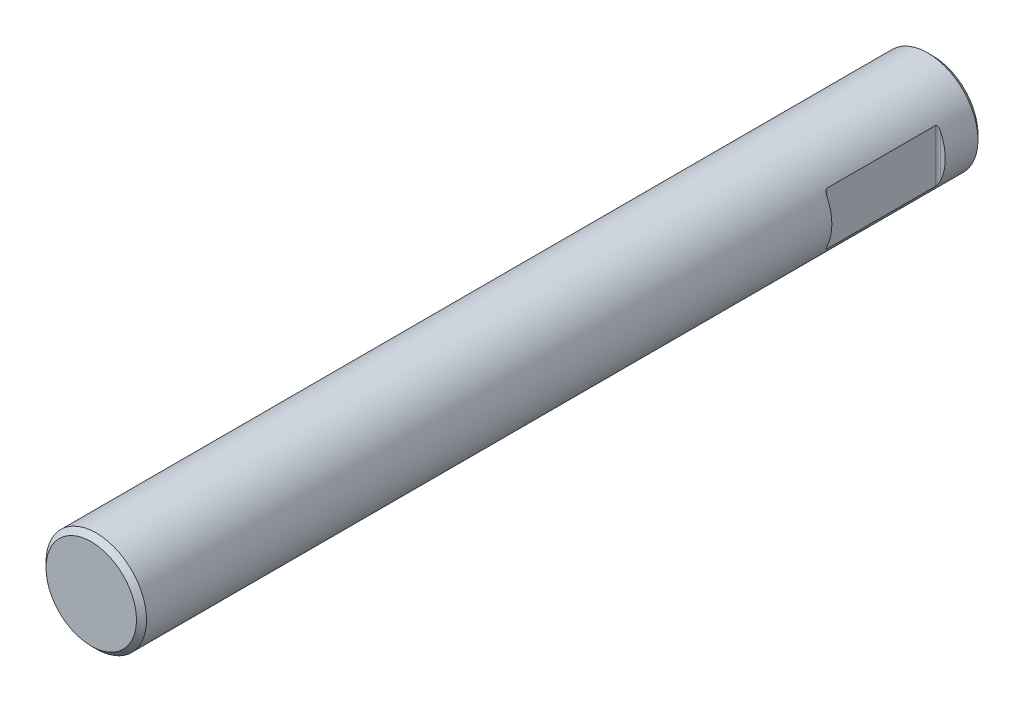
ISO-10303-21;
HEADER;
FILE_DESCRIPTION(('STEP AP214'),'2;1');
FILE_NAME('part.step','',(''),(''),'','','');
FILE_SCHEMA(('AUTOMOTIVE_DESIGN { 1 0 10303 214 1 1 1 1 }'));
ENDSEC;
DATA;
#1=APPLICATION_CONTEXT('core data for automotive mechanical design processes');
#2=APPLICATION_PROTOCOL_DEFINITION('international standard','automotive_design',2000,#1);
#3=PRODUCT_CONTEXT('',#1,'mechanical');
#4=PRODUCT('Part','Part','',(#3));
#5=PRODUCT_RELATED_PRODUCT_CATEGORY('part','',(#4));
#6=PRODUCT_DEFINITION_FORMATION('','',#4);
#7=PRODUCT_DEFINITION_CONTEXT('part definition',#1,'design');
#8=PRODUCT_DEFINITION('design','',#6,#7);
#9=PRODUCT_DEFINITION_SHAPE('','',#8);
#10=(LENGTH_UNIT() NAMED_UNIT(*) SI_UNIT(.MILLI.,.METRE.));
#11=(NAMED_UNIT(*) PLANE_ANGLE_UNIT() SI_UNIT($,.RADIAN.));
#12=(NAMED_UNIT(*) SI_UNIT($,.STERADIAN.) SOLID_ANGLE_UNIT());
#13=UNCERTAINTY_MEASURE_WITH_UNIT(LENGTH_MEASURE(1.E-05),#10,'distance_accuracy_value','');
#14=(GEOMETRIC_REPRESENTATION_CONTEXT(3) GLOBAL_UNCERTAINTY_ASSIGNED_CONTEXT((#13)) GLOBAL_UNIT_ASSIGNED_CONTEXT((#10,
#11,#12)) REPRESENTATION_CONTEXT('',''));
#15=CARTESIAN_POINT('',(0.,0.,0.));
#16=DIRECTION('',(0.,0.,1.));
#17=DIRECTION('',(1.,0.,0.));
#18=AXIS2_PLACEMENT_3D('',#15,#16,#17);
#19=CARTESIAN_POINT('',(0.,0.,0.));
#20=DIRECTION('',(0.,0.,-1.));
#21=DIRECTION('',(-1.,0.,0.));
#22=AXIS2_PLACEMENT_3D('',#19,#20,#21);
#23=PLANE('',#22);
#24=CARTESIAN_POINT('',(0.,0.,0.));
#25=DIRECTION('',(0.,0.,-1.));
#26=DIRECTION('',(-1.,0.,0.));
#27=AXIS2_PLACEMENT_3D('',#24,#25,#26);
#28=CIRCLE('',#27,1.795);
#29=CARTESIAN_POINT('',(-1.795,0.,0.));
#30=VERTEX_POINT('',#29);
#31=EDGE_CURVE('E203',#30,#30,#28,.F.);
#32=ORIENTED_EDGE('',*,*,#31,.T.);
#33=EDGE_LOOP('',(#32));
#34=FACE_BOUND('',#33,.T.);
#35=ADVANCED_FACE('F46',(#34),#23,.F.);
#36=CARTESIAN_POINT('',(0.,0.,50.5169014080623));
#37=DIRECTION('',(0.,0.,1.));
#38=DIRECTION('',(1.,0.,0.));
#39=AXIS2_PLACEMENT_3D('',#36,#37,#38);
#40=CYLINDRICAL_SURFACE('',#39,1.995);
#41=CARTESIAN_POINT('',(1.8,-0.860247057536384,-27.4));
#42=CARTESIAN_POINT('',(1.80686605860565,-0.845880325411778,-27.4000003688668));
#43=CARTESIAN_POINT('',(1.81355871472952,-0.831433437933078,-27.4007019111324));
#44=CARTESIAN_POINT('',(1.82655486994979,-0.802479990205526,-27.4033621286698));
#45=CARTESIAN_POINT('',(1.83285831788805,-0.787973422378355,-27.405320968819));
#46=CARTESIAN_POINT('',(1.84502526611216,-0.759047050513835,-27.4104667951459));
#47=CARTESIAN_POINT('',(1.850890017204,-0.744627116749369,-27.4136501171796));
#48=CARTESIAN_POINT('',(1.86215747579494,-0.715981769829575,-27.4213642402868));
#49=CARTESIAN_POINT('',(1.86756101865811,-0.701756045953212,-27.4258925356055));
#50=CARTESIAN_POINT('',(1.87515157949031,-0.681089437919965,-27.4339332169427));
#51=CARTESIAN_POINT('',(1.87754804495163,-0.674452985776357,-27.4367463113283));
#52=CARTESIAN_POINT('',(1.88219741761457,-0.661366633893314,-27.4429150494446));
#53=CARTESIAN_POINT('',(1.88445018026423,-0.654916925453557,-27.4462712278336));
#54=CARTESIAN_POINT('',(1.88822131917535,-0.643948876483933,-27.4528043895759));
#55=CARTESIAN_POINT('',(1.88978303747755,-0.639349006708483,-27.455818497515));
#56=CARTESIAN_POINT('',(1.89274346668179,-0.630530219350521,-27.4624253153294));
#57=CARTESIAN_POINT('',(1.89414284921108,-0.626309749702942,-27.466015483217));
#58=CARTESIAN_POINT('',(1.89593534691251,-0.620851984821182,-27.4717243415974));
#59=CARTESIAN_POINT('',(1.89644376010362,-0.619296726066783,-27.4734993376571));
#60=CARTESIAN_POINT('',(1.89739206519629,-0.616385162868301,-27.4772292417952));
#61=CARTESIAN_POINT('',(1.89783188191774,-0.615029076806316,-27.4791843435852));
#62=CARTESIAN_POINT('',(1.89862174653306,-0.612586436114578,-27.483319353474));
#63=CARTESIAN_POINT('',(1.89897033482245,-0.611504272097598,-27.4855022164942));
#64=CARTESIAN_POINT('',(1.89952939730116,-0.609765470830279,-27.4900466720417));
#65=CARTESIAN_POINT('',(1.89974041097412,-0.609107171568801,-27.4924075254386));
#66=CARTESIAN_POINT('',(1.89995541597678,-0.608436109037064,-27.4965459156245));
#67=CARTESIAN_POINT('',(1.90000098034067,-0.608293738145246,-27.4983004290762));
#68=CARTESIAN_POINT('',(1.8999989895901,-0.608299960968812,-27.5018092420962));
#69=CARTESIAN_POINT('',(1.89995143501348,-0.608448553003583,-27.5035635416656));
#70=CARTESIAN_POINT('',(1.89976868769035,-0.60901889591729,-27.5070134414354));
#71=CARTESIAN_POINT('',(1.89963386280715,-0.609439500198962,-27.5087092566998));
#72=CARTESIAN_POINT('',(1.89928928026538,-0.610512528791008,-27.5120171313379));
#73=CARTESIAN_POINT('',(1.89907946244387,-0.611165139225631,-27.513629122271));
#74=CARTESIAN_POINT('',(1.89844319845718,-0.613139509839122,-27.5177693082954));
#75=CARTESIAN_POINT('',(1.89796454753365,-0.614620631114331,-27.5202129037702));
#76=CARTESIAN_POINT('',(1.89689520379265,-0.617913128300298,-27.524839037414));
#77=CARTESIAN_POINT('',(1.89630413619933,-0.619725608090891,-27.5270206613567));
#78=CARTESIAN_POINT('',(1.8944304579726,-0.625438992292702,-27.5331869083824));
#79=CARTESIAN_POINT('',(1.89303701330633,-0.629648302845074,-27.5368473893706));
#80=CARTESIAN_POINT('',(1.89008377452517,-0.638459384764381,-27.5435688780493));
#81=CARTESIAN_POINT('',(1.88852348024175,-0.643062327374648,-27.5466280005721));
#82=CARTESIAN_POINT('',(1.88433186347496,-0.655271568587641,-27.5539946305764));
#83=CARTESIAN_POINT('',(1.88161241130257,-0.663045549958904,-27.5579718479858));
#84=CARTESIAN_POINT('',(1.87596539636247,-0.678859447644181,-27.565191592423));
#85=CARTESIAN_POINT('',(1.87303739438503,-0.686899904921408,-27.5684325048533));
#86=CARTESIAN_POINT('',(1.86396788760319,-0.71130118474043,-27.5773360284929));
#87=CARTESIAN_POINT('',(1.85756294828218,-0.727877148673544,-27.5821456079));
#88=CARTESIAN_POINT('',(1.84504549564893,-0.758997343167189,-27.5895307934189));
#89=CARTESIAN_POINT('',(1.83900420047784,-0.773523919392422,-27.5923162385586));
#90=CARTESIAN_POINT('',(1.82649943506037,-0.802605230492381,-27.5966527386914));
#91=CARTESIAN_POINT('',(1.82003546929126,-0.817159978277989,-27.5982023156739));
#92=CARTESIAN_POINT('',(1.80674565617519,-0.846137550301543,-27.5999965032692));
#93=CARTESIAN_POINT('',(1.79992084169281,-0.860560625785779,-27.6002446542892));
#94=CARTESIAN_POINT('',(1.78595248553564,-0.889185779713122,-27.5992558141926));
#95=CARTESIAN_POINT('',(1.77880945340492,-0.903388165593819,-27.5980211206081));
#96=CARTESIAN_POINT('',(1.76484866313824,-0.930348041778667,-27.5938796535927));
#97=CARTESIAN_POINT('',(1.75804691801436,-0.943133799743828,-27.5911057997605));
#98=CARTESIAN_POINT('',(1.74444649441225,-0.968054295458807,-27.5835151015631));
#99=CARTESIAN_POINT('',(1.73764805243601,-0.980192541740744,-27.5787108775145));
#100=CARTESIAN_POINT('',(1.72872508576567,-0.995769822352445,-27.5702148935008));
#101=CARTESIAN_POINT('',(1.72640404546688,-0.999787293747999,-27.567791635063));
#102=CARTESIAN_POINT('',(1.72185997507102,-1.00759290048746,-27.5625010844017));
#103=CARTESIAN_POINT('',(1.71963707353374,-1.01138073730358,-27.5596332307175));
#104=CARTESIAN_POINT('',(1.71533870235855,-1.01865409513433,-27.5533579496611));
#105=CARTESIAN_POINT('',(1.71326476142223,-1.02213654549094,-27.549945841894));
#106=CARTESIAN_POINT('',(1.70939757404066,-1.02859077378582,-27.542527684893));
#107=CARTESIAN_POINT('',(1.70760362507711,-1.03156383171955,-27.5385231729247));
#108=CARTESIAN_POINT('',(1.70501804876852,-1.03582930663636,-27.5314198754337));
#109=CARTESIAN_POINT('',(1.70409649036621,-1.03734397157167,-27.528502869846));
#110=CARTESIAN_POINT('',(1.70249688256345,-1.03996717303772,-27.5224272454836));
#111=CARTESIAN_POINT('',(1.70181862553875,-1.04107605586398,-27.5192688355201));
#112=CARTESIAN_POINT('',(1.70075882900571,-1.04280653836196,-27.5127364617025));
#113=CARTESIAN_POINT('',(1.70038018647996,-1.04342338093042,-27.5093607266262));
#114=CARTESIAN_POINT('',(1.69997378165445,-1.04408539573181,-27.5025330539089));
#115=CARTESIAN_POINT('',(1.6999457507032,-1.04413100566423,-27.4990811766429));
#116=CARTESIAN_POINT('',(1.70022472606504,-1.04367663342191,-27.4926528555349));
#117=CARTESIAN_POINT('',(1.70049141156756,-1.0432423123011,-27.489669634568));
#118=CARTESIAN_POINT('',(1.70127262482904,-1.04196785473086,-27.4838255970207));
#119=CARTESIAN_POINT('',(1.70178728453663,-1.04112750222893,-27.4809648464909));
#120=CARTESIAN_POINT('',(1.7032277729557,-1.03876975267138,-27.4745186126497));
#121=CARTESIAN_POINT('',(1.70423283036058,-1.03712114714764,-27.4709991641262));
#122=CARTESIAN_POINT('',(1.7065162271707,-1.0333596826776,-27.464316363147));
#123=CARTESIAN_POINT('',(1.70779511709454,-1.03124588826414,-27.4611537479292));
#124=CARTESIAN_POINT('',(1.71129306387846,-1.02543541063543,-27.4535576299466));
#125=CARTESIAN_POINT('',(1.71364530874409,-1.02150285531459,-27.4493677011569));
#126=CARTESIAN_POINT('',(1.71861000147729,-1.01312818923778,-27.4417207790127));
#127=CARTESIAN_POINT('',(1.72122310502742,-1.00868478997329,-27.4382657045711));
#128=CARTESIAN_POINT('',(1.72878232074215,-0.99570555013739,-27.4293962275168));
#129=CARTESIAN_POINT('',(1.73389199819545,-0.986789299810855,-27.4246840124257));
#130=CARTESIAN_POINT('',(1.74422752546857,-0.96840495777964,-27.4167437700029));
#131=CARTESIAN_POINT('',(1.74945357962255,-0.958935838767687,-27.4135186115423));
#132=CARTESIAN_POINT('',(1.76242054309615,-0.934966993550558,-27.4069202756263));
#133=CARTESIAN_POINT('',(1.77014368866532,-0.920268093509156,-27.4042434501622));
#134=CARTESIAN_POINT('',(1.78530948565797,-0.890492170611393,-27.4007807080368));
#135=CARTESIAN_POINT('',(1.79275137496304,-0.875414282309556,-27.3999996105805));
#136=CARTESIAN_POINT('',(1.8,-0.860247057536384,-27.4));
#137=B_SPLINE_CURVE_WITH_KNOTS('',3,(#41,#42,#43,#44,#45,#46,#47,#48,#49,#50,#51,#52,#53,#54,
#55,#56,#57,#58,#59,#60,#61,#62,#63,#64,#65,#66,#67,#68,#69,#70,#71,#72,#73,#74,#75,#76,#77,#78,
#79,#80,#81,#82,#83,#84,#85,#86,#87,#88,#89,#90,#91,#92,#93,#94,#95,#96,#97,#98,#99,#100,#101,
#102,#103,#104,#105,#106,#107,#108,#109,#110,#111,#112,#113,#114,#115,#116,#117,#118,#119,#120,
#121,#122,#123,#124,#125,#126,#127,#128,#129,#130,#131,#132,#133,#134,#135,#136),.UNSPECIFIED.,
.T.,.F.,(4,2,2,2,2,2,2,2,2,2,2,2,2,2,2,2,2,2,2,2,2,2,2,2,2,2,2,2,2,2,2,2,2,2,2,2,2,2,2,2,2,2,2,
2,2,2,2,4),(0.,0.0477530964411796,0.0955124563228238,0.143129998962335,0.190659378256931,
0.21343345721,0.236230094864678,0.253359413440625,0.270415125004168,0.277645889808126,
0.284884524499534,0.292232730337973,0.299551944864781,0.304809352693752,0.310066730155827,
0.315302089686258,0.320541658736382,0.329182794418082,0.337853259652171,0.35500620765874,
0.372212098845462,0.399583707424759,0.427014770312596,0.482103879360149,0.529991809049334,
0.577936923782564,0.625751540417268,0.673492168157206,0.717637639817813,0.761512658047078,
0.777197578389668,0.792902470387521,0.808750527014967,0.824558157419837,0.834765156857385,
0.844963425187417,0.855259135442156,0.865546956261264,0.874583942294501,0.883625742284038,
0.895601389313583,0.907601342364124,0.926123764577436,0.944693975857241,0.978419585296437,
1.01220998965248,1.06249611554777,1.11290994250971),.UNSPECIFIED.);
#138=CARTESIAN_POINT('',(1.7,-1.04404262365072,-27.5));
#139=VERTEX_POINT('',#138);
#140=CARTESIAN_POINT('',(1.8,-0.860247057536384,-27.4));
#141=VERTEX_POINT('',#140);
#142=EDGE_CURVE('E54',#139,#141,#137,.T.);
#143=ORIENTED_EDGE('',*,*,#142,.T.);
#144=CARTESIAN_POINT('',(0.,0.,-27.4));
#145=DIRECTION('',(0.,0.,1.));
#146=DIRECTION('',(1.,0.,0.));
#147=AXIS2_PLACEMENT_3D('',#144,#145,#146);
#148=CIRCLE('',#147,1.995);
#149=CARTESIAN_POINT('',(1.8,0.860247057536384,-27.4));
#150=VERTEX_POINT('',#149);
#151=EDGE_CURVE('E13',#141,#150,#148,.T.);
#152=ORIENTED_EDGE('',*,*,#151,.T.);
#153=CARTESIAN_POINT('',(1.8,0.860247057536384,-27.4));
#154=CARTESIAN_POINT('',(1.78989779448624,0.881382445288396,-27.3999925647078));
#155=CARTESIAN_POINT('',(1.7793987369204,0.902384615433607,-27.4014911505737));
#156=CARTESIAN_POINT('',(1.76333810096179,0.933166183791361,-27.4067955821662));
#157=CARTESIAN_POINT('',(1.75793592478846,0.943300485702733,-27.4090708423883));
#158=CARTESIAN_POINT('',(1.74712197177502,0.9631803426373,-27.4149007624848));
#159=CARTESIAN_POINT('',(1.74171025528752,0.972926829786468,-27.4184521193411));
#160=CARTESIAN_POINT('',(1.73259742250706,0.989035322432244,-27.4259667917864));
#161=CARTESIAN_POINT('',(1.72885258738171,0.995563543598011,-27.4295167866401));
#162=CARTESIAN_POINT('',(1.72160038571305,1.00805176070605,-27.4376837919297));
#163=CARTESIAN_POINT('',(1.71809202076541,1.01401419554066,-27.4422958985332));
#164=CARTESIAN_POINT('',(1.7131773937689,1.02228130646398,-27.4502826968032));
#165=CARTESIAN_POINT('',(1.71158129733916,1.02495024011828,-27.4531616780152));
#166=CARTESIAN_POINT('',(1.70858793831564,1.02993233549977,-27.4593117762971));
#167=CARTESIAN_POINT('',(1.70719058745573,1.03224565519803,-27.4625827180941));
#168=CARTESIAN_POINT('',(1.70488569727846,1.03604725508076,-27.4689699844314));
#169=CARTESIAN_POINT('',(1.70393554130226,1.03760835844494,-27.4720269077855));
#170=CARTESIAN_POINT('',(1.70230567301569,1.04028018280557,-27.4783995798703));
#171=CARTESIAN_POINT('',(1.70162554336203,1.04139159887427,-27.4817149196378));
#172=CARTESIAN_POINT('',(1.70067842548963,1.04293748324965,-27.488010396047));
#173=CARTESIAN_POINT('',(1.70036413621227,1.04344952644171,-27.4909641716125));
#174=CARTESIAN_POINT('',(1.70000252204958,1.04403857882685,-27.4969309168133));
#175=CARTESIAN_POINT('',(1.69995506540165,1.04411580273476,-27.4999438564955));
#176=CARTESIAN_POINT('',(1.70013147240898,1.04382852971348,-27.50593896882));
#177=CARTESIAN_POINT('',(1.70035524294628,1.04346418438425,-27.5089211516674));
#178=CARTESIAN_POINT('',(1.70105353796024,1.04232542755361,-27.5147754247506));
#179=CARTESIAN_POINT('',(1.70152824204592,1.04155072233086,-27.5176474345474));
#180=CARTESIAN_POINT('',(1.7028661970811,1.039362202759,-27.5240560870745));
#181=CARTESIAN_POINT('',(1.7038031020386,1.0378266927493,-27.5275355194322));
#182=CARTESIAN_POINT('',(1.70594998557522,1.03429393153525,-27.5341581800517));
#183=CARTESIAN_POINT('',(1.70716049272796,1.0322957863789,-27.537300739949));
#184=CARTESIAN_POINT('',(1.71046088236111,1.02682192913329,-27.5448025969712));
#185=CARTESIAN_POINT('',(1.71267954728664,1.02312003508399,-27.5489385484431));
#186=CARTESIAN_POINT('',(1.71737983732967,1.01521080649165,-27.5565137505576));
#187=CARTESIAN_POINT('',(1.71986210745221,1.01100222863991,-27.5599512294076));
#188=CARTESIAN_POINT('',(1.72701490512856,0.99876253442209,-27.5687504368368));
#189=CARTESIAN_POINT('',(1.73185060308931,0.990361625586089,-27.5734580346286));
#190=CARTESIAN_POINT('',(1.74165972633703,0.973009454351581,-27.5814624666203));
#191=CARTESIAN_POINT('',(1.7466334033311,0.964057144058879,-27.5847565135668));
#192=CARTESIAN_POINT('',(1.76130626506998,0.937140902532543,-27.5928817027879));
#193=CARTESIAN_POINT('',(1.77099427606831,0.918715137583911,-27.5961885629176));
#194=CARTESIAN_POINT('',(1.78991567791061,0.88129051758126,-27.599954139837));
#195=CARTESIAN_POINT('',(1.79914616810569,0.862288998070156,-27.6003965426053));
#196=CARTESIAN_POINT('',(1.81468594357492,0.828966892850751,-27.5991380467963));
#197=CARTESIAN_POINT('',(1.82113898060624,0.814690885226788,-27.5979559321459));
#198=CARTESIAN_POINT('',(1.83365404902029,0.786117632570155,-27.5943919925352));
#199=CARTESIAN_POINT('',(1.83971611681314,0.771820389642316,-27.5920102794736));
#200=CARTESIAN_POINT('',(1.85137691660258,0.743413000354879,-27.5860404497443));
#201=CARTESIAN_POINT('',(1.85697861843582,0.729302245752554,-27.582460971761));
#202=CARTESIAN_POINT('',(1.86771698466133,0.701341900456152,-27.5739071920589));
#203=CARTESIAN_POINT('',(1.8728547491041,0.687491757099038,-27.5689363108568));
#204=CARTESIAN_POINT('',(1.87954634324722,0.668850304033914,-27.5606689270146));
#205=CARTESIAN_POINT('',(1.88134864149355,0.663762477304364,-27.5582428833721));
#206=CARTESIAN_POINT('',(1.88485966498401,0.653725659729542,-27.5529991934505));
#207=CARTESIAN_POINT('',(1.88656799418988,0.648777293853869,-27.5501800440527));
#208=CARTESIAN_POINT('',(1.88987062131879,0.639093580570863,-27.5439975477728));
#209=CARTESIAN_POINT('',(1.89146317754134,0.634361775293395,-27.5406276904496));
#210=CARTESIAN_POINT('',(1.89443036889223,0.625443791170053,-27.5331529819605));
#211=CARTESIAN_POINT('',(1.89580663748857,0.621253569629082,-27.5290541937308));
#212=CARTESIAN_POINT('',(1.89738449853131,0.616408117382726,-27.5227822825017));
#213=CARTESIAN_POINT('',(1.89777052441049,0.61521814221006,-27.5210760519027));
#214=CARTESIAN_POINT('',(1.89847096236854,0.613053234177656,-27.5175151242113));
#215=CARTESIAN_POINT('',(1.8987853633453,0.612078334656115,-27.5156604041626));
#216=CARTESIAN_POINT('',(1.89932285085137,0.610408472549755,-27.5117829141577));
#217=CARTESIAN_POINT('',(1.89954467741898,0.609717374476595,-27.5097582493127));
#218=CARTESIAN_POINT('',(1.89986419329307,0.608721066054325,-27.5056073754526));
#219=CARTESIAN_POINT('',(1.89996216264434,0.608414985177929,-27.5034814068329));
#220=CARTESIAN_POINT('',(1.90001658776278,0.608244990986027,-27.4994429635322));
#221=CARTESIAN_POINT('',(1.89998732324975,0.60833645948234,-27.4975325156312));
#222=CARTESIAN_POINT('',(1.89982306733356,0.608849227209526,-27.4937607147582));
#223=CARTESIAN_POINT('',(1.89968796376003,0.609270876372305,-27.4918994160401));
#224=CARTESIAN_POINT('',(1.89928768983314,0.610517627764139,-27.4878805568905));
#225=CARTESIAN_POINT('',(1.8990006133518,0.611410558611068,-27.4857466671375));
#226=CARTESIAN_POINT('',(1.89832489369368,0.613505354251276,-27.4816551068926));
#227=CARTESIAN_POINT('',(1.89793604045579,0.61470785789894,-27.4796978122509));
#228=CARTESIAN_POINT('',(1.89677514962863,0.618283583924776,-27.4745904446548));
#229=CARTESIAN_POINT('',(1.89593027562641,0.620871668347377,-27.4716096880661));
#230=CARTESIAN_POINT('',(1.89410783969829,0.626409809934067,-27.4660564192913));
#231=CARTESIAN_POINT('',(1.89312986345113,0.629360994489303,-27.4634852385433));
#232=CARTESIAN_POINT('',(1.88914897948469,0.641269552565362,-27.4540475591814));
#233=CARTESIAN_POINT('',(1.88582864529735,0.650986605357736,-27.4483001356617));
#234=CARTESIAN_POINT('',(1.87881371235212,0.670969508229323,-27.4381530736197));
#235=CARTESIAN_POINT('',(1.87511674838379,0.681238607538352,-27.433762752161));
#236=CARTESIAN_POINT('',(1.86707735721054,0.702988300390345,-27.4255919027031));
#237=CARTESIAN_POINT('',(1.86270681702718,0.71449387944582,-27.4219036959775));
#238=CARTESIAN_POINT('',(1.85366226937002,0.737642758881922,-27.4154364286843));
#239=CARTESIAN_POINT('',(1.8489879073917,0.749286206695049,-27.4126584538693));
#240=CARTESIAN_POINT('',(1.83458408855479,0.784190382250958,-27.4055588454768));
#241=CARTESIAN_POINT('',(1.82443089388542,0.807541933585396,-27.4024311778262));
#242=CARTESIAN_POINT('',(1.80928842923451,0.840606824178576,-27.4003310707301));
#243=CARTESIAN_POINT('',(1.80468692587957,0.850441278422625,-27.4000034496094));
#244=CARTESIAN_POINT('',(1.8,0.860247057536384,-27.4));
#245=B_SPLINE_CURVE_WITH_KNOTS('',3,(#153,#154,#155,#156,#157,#158,#159,#160,#161,#162,#163,
#164,#165,#166,#167,#168,#169,#170,#171,#172,#173,#174,#175,#176,#177,#178,#179,#180,#181,#182,
#183,#184,#185,#186,#187,#188,#189,#190,#191,#192,#193,#194,#195,#196,#197,#198,#199,#200,#201,
#202,#203,#204,#205,#206,#207,#208,#209,#210,#211,#212,#213,#214,#215,#216,#217,#218,#219,#220,
#221,#222,#223,#224,#225,#226,#227,#228,#229,#230,#231,#232,#233,#234,#235,#236,#237,#238,#239,
#240,#241,#242,#243,#244),.UNSPECIFIED.,.T.,.F.,(4,2,2,2,2,2,2,2,2,2,2,2,2,2,2,2,2,2,2,2,2,2,2,
2,2,2,2,2,2,2,2,2,2,2,2,2,2,2,2,2,2,2,2,2,2,4),(0.,0.0702347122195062,0.105309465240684,
0.140294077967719,0.165201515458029,0.189996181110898,0.202681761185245,0.2153616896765,
0.226007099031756,0.236635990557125,0.24563806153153,0.254635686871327,0.263630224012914,
0.272631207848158,0.284316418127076,0.296024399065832,0.313856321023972,0.331732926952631,
0.363878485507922,0.39608714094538,0.45897332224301,0.52221734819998,0.569300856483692,
0.616379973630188,0.663126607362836,0.709759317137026,0.727502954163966,0.745316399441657,
0.763358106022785,0.781256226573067,0.787590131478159,0.793925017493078,0.800343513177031,
0.806747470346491,0.812452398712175,0.818163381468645,0.825117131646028,0.832085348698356,
0.844127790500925,0.856208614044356,0.89123906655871,0.926504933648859,0.96499184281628,
1.00352449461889,1.08019955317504,1.11278500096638),.UNSPECIFIED.);
#246=CARTESIAN_POINT('',(1.7,1.04404262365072,-27.5));
#247=VERTEX_POINT('',#246);
#248=EDGE_CURVE('E351',#150,#247,#245,.T.);
#249=ORIENTED_EDGE('',*,*,#248,.T.);
#250=DIRECTION('',(0.,0.,1.));
#251=VECTOR('',#250,1.);
#252=CARTESIAN_POINT('',(1.70000000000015,1.04404262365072,50.5169014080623));
#253=LINE('',#252,#251);
#254=CARTESIAN_POINT('',(1.69999999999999,1.04404262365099,-31.8));
#255=VERTEX_POINT('',#254);
#256=EDGE_CURVE('E129',#247,#255,#253,.F.);
#257=ORIENTED_EDGE('',*,*,#256,.T.);
#258=CARTESIAN_POINT('',(1.8,0.86024705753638,-31.7));
#259=CARTESIAN_POINT('',(1.78989779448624,0.881382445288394,-31.6999925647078));
#260=CARTESIAN_POINT('',(1.7793987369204,0.902384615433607,-31.7014911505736));
#261=CARTESIAN_POINT('',(1.76333810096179,0.933166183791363,-31.7067955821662));
#262=CARTESIAN_POINT('',(1.75793592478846,0.943300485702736,-31.7090708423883));
#263=CARTESIAN_POINT('',(1.74712197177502,0.963180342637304,-31.7149007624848));
#264=CARTESIAN_POINT('',(1.74171025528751,0.972926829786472,-31.7184521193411));
#265=CARTESIAN_POINT('',(1.73259742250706,0.989035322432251,-31.7259667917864));
#266=CARTESIAN_POINT('',(1.72885258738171,0.995563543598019,-31.7295167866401));
#267=CARTESIAN_POINT('',(1.72160038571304,1.00805176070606,-31.7376837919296));
#268=CARTESIAN_POINT('',(1.7180920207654,1.01401419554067,-31.7422958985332));
#269=CARTESIAN_POINT('',(1.71317739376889,1.022281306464,-31.7502826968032));
#270=CARTESIAN_POINT('',(1.71158129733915,1.02495024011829,-31.7531616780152));
#271=CARTESIAN_POINT('',(1.70858793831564,1.02993233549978,-31.7593117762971));
#272=CARTESIAN_POINT('',(1.70719058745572,1.03224565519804,-31.7625827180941));
#273=CARTESIAN_POINT('',(1.70488569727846,1.03604725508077,-31.7689699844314));
#274=CARTESIAN_POINT('',(1.70393554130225,1.03760835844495,-31.7720269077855));
#275=CARTESIAN_POINT('',(1.70230567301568,1.04028018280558,-31.7783995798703));
#276=CARTESIAN_POINT('',(1.70162554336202,1.04139159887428,-31.7817149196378));
#277=CARTESIAN_POINT('',(1.70067842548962,1.04293748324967,-31.788010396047));
#278=CARTESIAN_POINT('',(1.70036413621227,1.04344952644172,-31.7909641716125));
#279=CARTESIAN_POINT('',(1.70000252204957,1.04403857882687,-31.7969309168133));
#280=CARTESIAN_POINT('',(1.69995506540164,1.04411580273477,-31.7999438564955));
#281=CARTESIAN_POINT('',(1.70013147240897,1.04382852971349,-31.80593896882));
#282=CARTESIAN_POINT('',(1.70035524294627,1.04346418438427,-31.8089211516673));
#283=CARTESIAN_POINT('',(1.70105353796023,1.04232542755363,-31.8147754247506));
#284=CARTESIAN_POINT('',(1.70152824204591,1.04155072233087,-31.8176474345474));
#285=CARTESIAN_POINT('',(1.70286619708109,1.03936220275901,-31.8240560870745));
#286=CARTESIAN_POINT('',(1.70380310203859,1.0378266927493,-31.8275355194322));
#287=CARTESIAN_POINT('',(1.70594998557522,1.03429393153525,-31.8341581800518));
#288=CARTESIAN_POINT('',(1.70716049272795,1.0322957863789,-31.837300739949));
#289=CARTESIAN_POINT('',(1.71046088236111,1.02682192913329,-31.8448025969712));
#290=CARTESIAN_POINT('',(1.71267954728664,1.02312003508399,-31.8489385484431));
#291=CARTESIAN_POINT('',(1.71737983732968,1.01521080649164,-31.8565137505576));
#292=CARTESIAN_POINT('',(1.71986210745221,1.0110022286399,-31.8599512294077));
#293=CARTESIAN_POINT('',(1.72701490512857,0.998762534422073,-31.8687504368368));
#294=CARTESIAN_POINT('',(1.73185060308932,0.990361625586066,-31.8734580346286));
#295=CARTESIAN_POINT('',(1.74165972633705,0.973009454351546,-31.8814624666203));
#296=CARTESIAN_POINT('',(1.74663340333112,0.964057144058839,-31.8847565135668));
#297=CARTESIAN_POINT('',(1.76130626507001,0.937140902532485,-31.892881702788));
#298=CARTESIAN_POINT('',(1.77099427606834,0.918715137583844,-31.8961885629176));
#299=CARTESIAN_POINT('',(1.78991567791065,0.881290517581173,-31.8999541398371));
#300=CARTESIAN_POINT('',(1.79914616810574,0.862288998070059,-31.9003965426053));
#301=CARTESIAN_POINT('',(1.81468594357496,0.828966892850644,-31.8991380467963));
#302=CARTESIAN_POINT('',(1.82113898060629,0.814690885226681,-31.8979559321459));
#303=CARTESIAN_POINT('',(1.83365404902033,0.786117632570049,-31.8943919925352));
#304=CARTESIAN_POINT('',(1.83971611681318,0.771820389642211,-31.8920102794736));
#305=CARTESIAN_POINT('',(1.85137691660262,0.743413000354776,-31.8860404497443));
#306=CARTESIAN_POINT('',(1.85697861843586,0.729302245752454,-31.882460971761));
#307=CARTESIAN_POINT('',(1.86771698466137,0.701341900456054,-31.8739071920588));
#308=CARTESIAN_POINT('',(1.87285474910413,0.687491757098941,-31.8689363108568));
#309=CARTESIAN_POINT('',(1.87954634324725,0.668850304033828,-31.8606689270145));
#310=CARTESIAN_POINT('',(1.88134864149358,0.663762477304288,-31.858242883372));
#311=CARTESIAN_POINT('',(1.88485966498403,0.653725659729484,-31.8529991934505));
#312=CARTESIAN_POINT('',(1.8865679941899,0.648777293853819,-31.8501800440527));
#313=CARTESIAN_POINT('',(1.8898706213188,0.63909358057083,-31.8439975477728));
#314=CARTESIAN_POINT('',(1.89146317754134,0.634361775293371,-31.8406276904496));
#315=CARTESIAN_POINT('',(1.89443036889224,0.625443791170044,-31.8331529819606));
#316=CARTESIAN_POINT('',(1.89580663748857,0.621253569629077,-31.8290541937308));
#317=CARTESIAN_POINT('',(1.89738449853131,0.616408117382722,-31.8227822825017));
#318=CARTESIAN_POINT('',(1.89777052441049,0.615218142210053,-31.8210760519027));
#319=CARTESIAN_POINT('',(1.89847096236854,0.613053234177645,-31.8175151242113));
#320=CARTESIAN_POINT('',(1.8987853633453,0.612078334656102,-31.8156604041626));
#321=CARTESIAN_POINT('',(1.89932285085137,0.610408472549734,-31.8117829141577));
#322=CARTESIAN_POINT('',(1.89954467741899,0.60971737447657,-31.8097582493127));
#323=CARTESIAN_POINT('',(1.89986419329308,0.608721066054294,-31.8056073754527));
#324=CARTESIAN_POINT('',(1.89996216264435,0.608414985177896,-31.8034814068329));
#325=CARTESIAN_POINT('',(1.90001658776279,0.608244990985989,-31.7994429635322));
#326=CARTESIAN_POINT('',(1.89998732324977,0.608336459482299,-31.7975325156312));
#327=CARTESIAN_POINT('',(1.89982306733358,0.608849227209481,-31.7937607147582));
#328=CARTESIAN_POINT('',(1.89968796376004,0.609270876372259,-31.7918994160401));
#329=CARTESIAN_POINT('',(1.89928768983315,0.610517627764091,-31.7878805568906));
#330=CARTESIAN_POINT('',(1.89900061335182,0.611410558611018,-31.7857466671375));
#331=CARTESIAN_POINT('',(1.8983248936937,0.613505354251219,-31.7816551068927));
#332=CARTESIAN_POINT('',(1.89793604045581,0.61470785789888,-31.7796978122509));
#333=CARTESIAN_POINT('',(1.89677514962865,0.618283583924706,-31.7745904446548));
#334=CARTESIAN_POINT('',(1.89593027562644,0.620871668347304,-31.7716096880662));
#335=CARTESIAN_POINT('',(1.89410783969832,0.626409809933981,-31.7660564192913));
#336=CARTESIAN_POINT('',(1.89312986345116,0.629360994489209,-31.7634852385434));
#337=CARTESIAN_POINT('',(1.88914897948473,0.641269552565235,-31.7540475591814));
#338=CARTESIAN_POINT('',(1.88582864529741,0.650986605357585,-31.7483001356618));
#339=CARTESIAN_POINT('',(1.87881371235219,0.670969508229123,-31.7381530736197));
#340=CARTESIAN_POINT('',(1.87511674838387,0.681238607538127,-31.7337627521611));
#341=CARTESIAN_POINT('',(1.86707735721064,0.702988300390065,-31.7255919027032));
#342=CARTESIAN_POINT('',(1.8627068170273,0.714493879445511,-31.7219036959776));
#343=CARTESIAN_POINT('',(1.85366226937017,0.737642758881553,-31.7154364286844));
#344=CARTESIAN_POINT('',(1.84898790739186,0.749286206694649,-31.7126584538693));
#345=CARTESIAN_POINT('',(1.834584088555,0.784190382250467,-31.7055588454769));
#346=CARTESIAN_POINT('',(1.82443089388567,0.807541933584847,-31.7024311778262));
#347=CARTESIAN_POINT('',(1.8092884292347,0.840606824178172,-31.7003310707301));
#348=CARTESIAN_POINT('',(1.80468692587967,0.850441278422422,-31.7000034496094));
#349=CARTESIAN_POINT('',(1.8,0.86024705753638,-31.7));
#350=B_SPLINE_CURVE_WITH_KNOTS('',3,(#258,#259,#260,#261,#262,#263,#264,#265,#266,#267,#268,
#269,#270,#271,#272,#273,#274,#275,#276,#277,#278,#279,#280,#281,#282,#283,#284,#285,#286,#287,
#288,#289,#290,#291,#292,#293,#294,#295,#296,#297,#298,#299,#300,#301,#302,#303,#304,#305,#306,
#307,#308,#309,#310,#311,#312,#313,#314,#315,#316,#317,#318,#319,#320,#321,#322,#323,#324,#325,
#326,#327,#328,#329,#330,#331,#332,#333,#334,#335,#336,#337,#338,#339,#340,#341,#342,#343,#344,
#345,#346,#347,#348,#349),.UNSPECIFIED.,.T.,.F.,(4,2,2,2,2,2,2,2,2,2,2,2,2,2,2,2,2,2,2,2,2,2,2,
2,2,2,2,2,2,2,2,2,2,2,2,2,2,2,2,2,2,2,2,2,2,4),(0.,0.0702347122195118,0.105309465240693,
0.140294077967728,0.165201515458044,0.189996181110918,0.202681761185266,0.21536168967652,
0.22600709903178,0.236635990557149,0.245638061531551,0.254635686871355,0.263630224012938,
0.272631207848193,0.284316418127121,0.296024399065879,0.313856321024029,0.331732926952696,
0.363878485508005,0.396087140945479,0.458973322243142,0.522217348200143,0.569300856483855,
0.616379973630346,0.663126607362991,0.709759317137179,0.727502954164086,0.745316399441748,
0.763358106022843,0.781256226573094,0.787590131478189,0.793925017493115,0.800343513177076,
0.806747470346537,0.812452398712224,0.818163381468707,0.825117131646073,0.832085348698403,
0.844127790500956,0.85620861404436,0.891239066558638,0.926504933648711,0.964991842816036,
1.00352449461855,1.0801995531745,1.1127850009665),.UNSPECIFIED.);
#351=CARTESIAN_POINT('',(1.8,0.86024705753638,-31.9));
#352=VERTEX_POINT('',#351);
#353=EDGE_CURVE('E114',#255,#352,#350,.T.);
#354=ORIENTED_EDGE('',*,*,#353,.T.);
#355=CARTESIAN_POINT('',(0.,0.,-31.9));
#356=DIRECTION('',(0.,0.,-1.));
#357=DIRECTION('',(-1.,0.,0.));
#358=AXIS2_PLACEMENT_3D('',#355,#356,#357);
#359=CIRCLE('',#358,1.995);
#360=CARTESIAN_POINT('',(1.8,-0.86024705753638,-31.9));
#361=VERTEX_POINT('',#360);
#362=EDGE_CURVE('E109',#352,#361,#359,.T.);
#363=ORIENTED_EDGE('',*,*,#362,.T.);
#364=CARTESIAN_POINT('',(1.8,-0.86024705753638,-31.7));
#365=CARTESIAN_POINT('',(1.80686605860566,-0.845880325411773,-31.7000003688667));
#366=CARTESIAN_POINT('',(1.81355871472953,-0.83143343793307,-31.7007019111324));
#367=CARTESIAN_POINT('',(1.8265548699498,-0.802479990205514,-31.7033621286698));
#368=CARTESIAN_POINT('',(1.83285831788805,-0.787973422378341,-31.7053209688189));
#369=CARTESIAN_POINT('',(1.84502526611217,-0.759047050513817,-31.7104667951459));
#370=CARTESIAN_POINT('',(1.85089001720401,-0.74462711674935,-31.7136501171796));
#371=CARTESIAN_POINT('',(1.86215747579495,-0.715981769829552,-31.7213642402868));
#372=CARTESIAN_POINT('',(1.86756101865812,-0.701756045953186,-31.7258925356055));
#373=CARTESIAN_POINT('',(1.87515157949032,-0.681089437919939,-31.7339332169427));
#374=CARTESIAN_POINT('',(1.87754804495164,-0.674452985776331,-31.7367463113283));
#375=CARTESIAN_POINT('',(1.88219741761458,-0.661366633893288,-31.7429150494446));
#376=CARTESIAN_POINT('',(1.88445018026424,-0.654916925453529,-31.7462712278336));
#377=CARTESIAN_POINT('',(1.88822131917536,-0.643948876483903,-31.7528043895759));
#378=CARTESIAN_POINT('',(1.88978303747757,-0.639349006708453,-31.7558184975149));
#379=CARTESIAN_POINT('',(1.8927434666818,-0.630530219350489,-31.7624253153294));
#380=CARTESIAN_POINT('',(1.89414284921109,-0.626309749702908,-31.766015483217));
#381=CARTESIAN_POINT('',(1.89593534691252,-0.620851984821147,-31.7717243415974));
#382=CARTESIAN_POINT('',(1.89644376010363,-0.619296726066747,-31.7734993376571));
#383=CARTESIAN_POINT('',(1.8973920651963,-0.616385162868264,-31.7772292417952));
#384=CARTESIAN_POINT('',(1.89783188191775,-0.615029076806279,-31.7791843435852));
#385=CARTESIAN_POINT('',(1.89862174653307,-0.61258643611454,-31.783319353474));
#386=CARTESIAN_POINT('',(1.89897033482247,-0.61150427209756,-31.7855022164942));
#387=CARTESIAN_POINT('',(1.89952939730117,-0.609765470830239,-31.7900466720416));
#388=CARTESIAN_POINT('',(1.89974041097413,-0.609107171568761,-31.7924075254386));
#389=CARTESIAN_POINT('',(1.89995541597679,-0.608436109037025,-31.7965459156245));
#390=CARTESIAN_POINT('',(1.90000098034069,-0.608293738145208,-31.7983004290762));
#391=CARTESIAN_POINT('',(1.89999898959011,-0.608299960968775,-31.8018092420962));
#392=CARTESIAN_POINT('',(1.89995143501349,-0.608448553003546,-31.8035635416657));
#393=CARTESIAN_POINT('',(1.89976868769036,-0.609018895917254,-31.8070134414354));
#394=CARTESIAN_POINT('',(1.89963386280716,-0.609439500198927,-31.8087092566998));
#395=CARTESIAN_POINT('',(1.89928928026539,-0.610512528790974,-31.8120171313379));
#396=CARTESIAN_POINT('',(1.89907946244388,-0.611165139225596,-31.813629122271));
#397=CARTESIAN_POINT('',(1.89844319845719,-0.613139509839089,-31.8177693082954));
#398=CARTESIAN_POINT('',(1.89796454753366,-0.614620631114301,-31.8202129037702));
#399=CARTESIAN_POINT('',(1.89689520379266,-0.61791312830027,-31.824839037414));
#400=CARTESIAN_POINT('',(1.89630413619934,-0.61972560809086,-31.8270206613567));
#401=CARTESIAN_POINT('',(1.89443045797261,-0.625438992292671,-31.8331869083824));
#402=CARTESIAN_POINT('',(1.89303701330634,-0.62964830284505,-31.8368473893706));
#403=CARTESIAN_POINT('',(1.89008377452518,-0.638459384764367,-31.8435688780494));
#404=CARTESIAN_POINT('',(1.88852348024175,-0.643062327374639,-31.8466280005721));
#405=CARTESIAN_POINT('',(1.88433186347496,-0.655271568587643,-31.8539946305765));
#406=CARTESIAN_POINT('',(1.88161241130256,-0.663045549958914,-31.8579718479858));
#407=CARTESIAN_POINT('',(1.87596539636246,-0.678859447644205,-31.8651915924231));
#408=CARTESIAN_POINT('',(1.87303739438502,-0.686899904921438,-31.8684325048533));
#409=CARTESIAN_POINT('',(1.86396788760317,-0.711301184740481,-31.8773360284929));
#410=CARTESIAN_POINT('',(1.85756294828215,-0.72787714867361,-31.8821456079));
#411=CARTESIAN_POINT('',(1.8450454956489,-0.758997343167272,-31.8895307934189));
#412=CARTESIAN_POINT('',(1.8390042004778,-0.773523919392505,-31.8923162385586));
#413=CARTESIAN_POINT('',(1.82649943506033,-0.802605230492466,-31.8966527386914));
#414=CARTESIAN_POINT('',(1.82003546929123,-0.817159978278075,-31.898202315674));
#415=CARTESIAN_POINT('',(1.80674565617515,-0.84613755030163,-31.8999965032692));
#416=CARTESIAN_POINT('',(1.79992084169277,-0.860560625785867,-31.9002446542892));
#417=CARTESIAN_POINT('',(1.78595248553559,-0.889185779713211,-31.8992558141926));
#418=CARTESIAN_POINT('',(1.77880945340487,-0.903388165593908,-31.8980211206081));
#419=CARTESIAN_POINT('',(1.7648486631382,-0.930348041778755,-31.8938796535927));
#420=CARTESIAN_POINT('',(1.75804691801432,-0.943133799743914,-31.8911057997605));
#421=CARTESIAN_POINT('',(1.7444464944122,-0.96805429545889,-31.8835151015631));
#422=CARTESIAN_POINT('',(1.73764805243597,-0.980192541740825,-31.8787108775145));
#423=CARTESIAN_POINT('',(1.72872508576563,-0.995769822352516,-31.8702148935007));
#424=CARTESIAN_POINT('',(1.72640404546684,-0.999787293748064,-31.8677916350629));
#425=CARTESIAN_POINT('',(1.72185997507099,-1.00759290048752,-31.8625010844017));
#426=CARTESIAN_POINT('',(1.71963707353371,-1.01138073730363,-31.8596332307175));
#427=CARTESIAN_POINT('',(1.71533870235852,-1.01865409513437,-31.853357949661));
#428=CARTESIAN_POINT('',(1.71326476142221,-1.02213654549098,-31.849945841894));
#429=CARTESIAN_POINT('',(1.70939757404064,-1.02859077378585,-31.842527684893));
#430=CARTESIAN_POINT('',(1.7076036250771,-1.03156383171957,-31.8385231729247));
#431=CARTESIAN_POINT('',(1.70501804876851,-1.03582930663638,-31.8314198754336));
#432=CARTESIAN_POINT('',(1.7040964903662,-1.03734397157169,-31.828502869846));
#433=CARTESIAN_POINT('',(1.70249688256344,-1.03996717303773,-31.8224272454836));
#434=CARTESIAN_POINT('',(1.70181862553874,-1.041076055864,-31.8192688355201));
#435=CARTESIAN_POINT('',(1.7007588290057,-1.04280653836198,-31.8127364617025));
#436=CARTESIAN_POINT('',(1.70038018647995,-1.04342338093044,-31.8093607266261));
#437=CARTESIAN_POINT('',(1.69997378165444,-1.04408539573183,-31.8025330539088));
#438=CARTESIAN_POINT('',(1.69994575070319,-1.04413100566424,-31.7990811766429));
#439=CARTESIAN_POINT('',(1.70022472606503,-1.04367663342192,-31.7926528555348));
#440=CARTESIAN_POINT('',(1.70049141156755,-1.04324231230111,-31.789669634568));
#441=CARTESIAN_POINT('',(1.70127262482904,-1.04196785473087,-31.7838255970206));
#442=CARTESIAN_POINT('',(1.70178728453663,-1.04112750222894,-31.7809648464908));
#443=CARTESIAN_POINT('',(1.70322777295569,-1.03876975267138,-31.7745186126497));
#444=CARTESIAN_POINT('',(1.70423283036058,-1.03712114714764,-31.7709991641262));
#445=CARTESIAN_POINT('',(1.7065162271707,-1.0333596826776,-31.764316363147));
#446=CARTESIAN_POINT('',(1.70779511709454,-1.03124588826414,-31.7611537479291));
#447=CARTESIAN_POINT('',(1.71129306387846,-1.02543541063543,-31.7535576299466));
#448=CARTESIAN_POINT('',(1.7136453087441,-1.02150285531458,-31.7493677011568));
#449=CARTESIAN_POINT('',(1.7186100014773,-1.01312818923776,-31.7417207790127));
#450=CARTESIAN_POINT('',(1.72122310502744,-1.00868478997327,-31.7382657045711));
#451=CARTESIAN_POINT('',(1.72878232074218,-0.995705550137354,-31.7293962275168));
#452=CARTESIAN_POINT('',(1.73389199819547,-0.986789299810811,-31.7246840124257));
#453=CARTESIAN_POINT('',(1.74422752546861,-0.968404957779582,-31.7167437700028));
#454=CARTESIAN_POINT('',(1.74945357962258,-0.958935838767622,-31.7135186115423));
#455=CARTESIAN_POINT('',(1.76242054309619,-0.934966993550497,-31.7069202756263));
#456=CARTESIAN_POINT('',(1.77014368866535,-0.920268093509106,-31.7042434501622));
#457=CARTESIAN_POINT('',(1.78530948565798,-0.890492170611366,-31.7007807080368));
#458=CARTESIAN_POINT('',(1.79275137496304,-0.875414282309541,-31.6999996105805));
#459=CARTESIAN_POINT('',(1.8,-0.86024705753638,-31.7));
#460=B_SPLINE_CURVE_WITH_KNOTS('',3,(#364,#365,#366,#367,#368,#369,#370,#371,#372,#373,#374,
#375,#376,#377,#378,#379,#380,#381,#382,#383,#384,#385,#386,#387,#388,#389,#390,#391,#392,#393,
#394,#395,#396,#397,#398,#399,#400,#401,#402,#403,#404,#405,#406,#407,#408,#409,#410,#411,#412,
#413,#414,#415,#416,#417,#418,#419,#420,#421,#422,#423,#424,#425,#426,#427,#428,#429,#430,#431,
#432,#433,#434,#435,#436,#437,#438,#439,#440,#441,#442,#443,#444,#445,#446,#447,#448,#449,#450,
#451,#452,#453,#454,#455,#456,#457,#458,#459),.UNSPECIFIED.,.T.,.F.,(4,2,2,2,2,2,2,2,2,2,2,2,2,
2,2,2,2,2,2,2,2,2,2,2,2,2,2,2,2,2,2,2,2,2,2,2,2,2,2,2,2,2,2,2,2,2,2,4),(0.,0.0477530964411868,
0.0955124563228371,0.143129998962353,0.190659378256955,0.213433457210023,0.236230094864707,
0.253359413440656,0.270415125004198,0.277645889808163,0.284884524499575,0.292232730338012,
0.299551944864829,0.304809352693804,0.310066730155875,0.315302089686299,0.320541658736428,
0.32918279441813,0.33785325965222,0.355006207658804,0.372212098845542,0.399583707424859,
0.427014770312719,0.482103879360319,0.529991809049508,0.57793692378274,0.625751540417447,
0.673492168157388,0.717637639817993,0.761512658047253,0.777197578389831,0.792902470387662,
0.808750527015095,0.824558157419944,0.834765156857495,0.844963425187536,0.855259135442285,
0.865546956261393,0.874583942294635,0.88362574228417,0.895601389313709,0.907601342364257,
0.926123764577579,0.944693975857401,0.978419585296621,1.01220998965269,1.06249611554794,
1.11290994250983),.UNSPECIFIED.);
#461=CARTESIAN_POINT('',(1.69999999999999,-1.04404262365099,-31.8));
#462=VERTEX_POINT('',#461);
#463=EDGE_CURVE('E121',#361,#462,#460,.T.);
#464=ORIENTED_EDGE('',*,*,#463,.T.);
#465=DIRECTION('',(0.,0.,1.));
#466=VECTOR('',#465,1.);
#467=CARTESIAN_POINT('',(1.70000000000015,-1.04404262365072,50.5169014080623));
#468=LINE('',#467,#466);
#469=EDGE_CURVE('E345',#462,#139,#468,.T.);
#470=ORIENTED_EDGE('',*,*,#469,.T.);
#471=EDGE_LOOP('',(#143,#152,#249,#257,#354,#363,#464,#470));
#472=FACE_BOUND('',#471,.T.);
#473=CARTESIAN_POINT('',(-1.8,-0.86024705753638,-31.7));
#474=CARTESIAN_POINT('',(-1.78989779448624,-0.881382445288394,-31.6999925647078));
#475=CARTESIAN_POINT('',(-1.7793987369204,-0.902384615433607,-31.7014911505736));
#476=CARTESIAN_POINT('',(-1.76333810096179,-0.933166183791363,-31.7067955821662));
#477=CARTESIAN_POINT('',(-1.75793592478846,-0.943300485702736,-31.7090708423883));
#478=CARTESIAN_POINT('',(-1.74712197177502,-0.963180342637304,-31.7149007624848));
#479=CARTESIAN_POINT('',(-1.74171025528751,-0.972926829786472,-31.7184521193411));
#480=CARTESIAN_POINT('',(-1.73259742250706,-0.989035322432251,-31.7259667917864));
#481=CARTESIAN_POINT('',(-1.72885258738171,-0.995563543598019,-31.7295167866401));
#482=CARTESIAN_POINT('',(-1.72160038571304,-1.00805176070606,-31.7376837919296));
#483=CARTESIAN_POINT('',(-1.7180920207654,-1.01401419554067,-31.7422958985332));
#484=CARTESIAN_POINT('',(-1.71317739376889,-1.022281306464,-31.7502826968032));
#485=CARTESIAN_POINT('',(-1.71158129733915,-1.02495024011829,-31.7531616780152));
#486=CARTESIAN_POINT('',(-1.70858793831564,-1.02993233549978,-31.7593117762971));
#487=CARTESIAN_POINT('',(-1.70719058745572,-1.03224565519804,-31.7625827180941));
#488=CARTESIAN_POINT('',(-1.70488569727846,-1.03604725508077,-31.7689699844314));
#489=CARTESIAN_POINT('',(-1.70393554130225,-1.03760835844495,-31.7720269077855));
#490=CARTESIAN_POINT('',(-1.70230567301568,-1.04028018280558,-31.7783995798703));
#491=CARTESIAN_POINT('',(-1.70162554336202,-1.04139159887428,-31.7817149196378));
#492=CARTESIAN_POINT('',(-1.70067842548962,-1.04293748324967,-31.788010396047));
#493=CARTESIAN_POINT('',(-1.70036413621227,-1.04344952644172,-31.7909641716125));
#494=CARTESIAN_POINT('',(-1.70000252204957,-1.04403857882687,-31.7969309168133));
#495=CARTESIAN_POINT('',(-1.69995506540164,-1.04411580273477,-31.7999438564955));
#496=CARTESIAN_POINT('',(-1.70013147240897,-1.04382852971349,-31.80593896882));
#497=CARTESIAN_POINT('',(-1.70035524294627,-1.04346418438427,-31.8089211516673));
#498=CARTESIAN_POINT('',(-1.70105353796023,-1.04232542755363,-31.8147754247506));
#499=CARTESIAN_POINT('',(-1.70152824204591,-1.04155072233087,-31.8176474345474));
#500=CARTESIAN_POINT('',(-1.70286619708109,-1.03936220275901,-31.8240560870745));
#501=CARTESIAN_POINT('',(-1.70380310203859,-1.0378266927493,-31.8275355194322));
#502=CARTESIAN_POINT('',(-1.70594998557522,-1.03429393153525,-31.8341581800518));
#503=CARTESIAN_POINT('',(-1.70716049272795,-1.0322957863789,-31.837300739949));
#504=CARTESIAN_POINT('',(-1.71046088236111,-1.02682192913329,-31.8448025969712));
#505=CARTESIAN_POINT('',(-1.71267954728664,-1.02312003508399,-31.8489385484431));
#506=CARTESIAN_POINT('',(-1.71737983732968,-1.01521080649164,-31.8565137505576));
#507=CARTESIAN_POINT('',(-1.71986210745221,-1.0110022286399,-31.8599512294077));
#508=CARTESIAN_POINT('',(-1.72701490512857,-0.998762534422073,-31.8687504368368));
#509=CARTESIAN_POINT('',(-1.73185060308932,-0.990361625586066,-31.8734580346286));
#510=CARTESIAN_POINT('',(-1.74165972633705,-0.973009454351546,-31.8814624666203));
#511=CARTESIAN_POINT('',(-1.74663340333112,-0.964057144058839,-31.8847565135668));
#512=CARTESIAN_POINT('',(-1.76130626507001,-0.937140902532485,-31.892881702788));
#513=CARTESIAN_POINT('',(-1.77099427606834,-0.918715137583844,-31.8961885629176));
#514=CARTESIAN_POINT('',(-1.78991567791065,-0.881290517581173,-31.8999541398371));
#515=CARTESIAN_POINT('',(-1.79914616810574,-0.862288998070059,-31.9003965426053));
#516=CARTESIAN_POINT('',(-1.81468594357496,-0.828966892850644,-31.8991380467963));
#517=CARTESIAN_POINT('',(-1.82113898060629,-0.814690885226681,-31.8979559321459));
#518=CARTESIAN_POINT('',(-1.83365404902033,-0.786117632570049,-31.8943919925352));
#519=CARTESIAN_POINT('',(-1.83971611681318,-0.771820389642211,-31.8920102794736));
#520=CARTESIAN_POINT('',(-1.85137691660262,-0.743413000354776,-31.8860404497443));
#521=CARTESIAN_POINT('',(-1.85697861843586,-0.729302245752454,-31.882460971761));
#522=CARTESIAN_POINT('',(-1.86771698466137,-0.701341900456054,-31.8739071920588));
#523=CARTESIAN_POINT('',(-1.87285474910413,-0.687491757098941,-31.8689363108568));
#524=CARTESIAN_POINT('',(-1.87954634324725,-0.668850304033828,-31.8606689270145));
#525=CARTESIAN_POINT('',(-1.88134864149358,-0.663762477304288,-31.858242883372));
#526=CARTESIAN_POINT('',(-1.88485966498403,-0.653725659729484,-31.8529991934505));
#527=CARTESIAN_POINT('',(-1.8865679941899,-0.648777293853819,-31.8501800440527));
#528=CARTESIAN_POINT('',(-1.8898706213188,-0.63909358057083,-31.8439975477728));
#529=CARTESIAN_POINT('',(-1.89146317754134,-0.634361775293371,-31.8406276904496));
#530=CARTESIAN_POINT('',(-1.89443036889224,-0.625443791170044,-31.8331529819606));
#531=CARTESIAN_POINT('',(-1.89580663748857,-0.621253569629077,-31.8290541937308));
#532=CARTESIAN_POINT('',(-1.89738449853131,-0.616408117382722,-31.8227822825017));
#533=CARTESIAN_POINT('',(-1.89777052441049,-0.615218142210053,-31.8210760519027));
#534=CARTESIAN_POINT('',(-1.89847096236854,-0.613053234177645,-31.8175151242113));
#535=CARTESIAN_POINT('',(-1.8987853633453,-0.612078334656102,-31.8156604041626));
#536=CARTESIAN_POINT('',(-1.89932285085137,-0.610408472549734,-31.8117829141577));
#537=CARTESIAN_POINT('',(-1.89954467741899,-0.60971737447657,-31.8097582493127));
#538=CARTESIAN_POINT('',(-1.89986419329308,-0.608721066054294,-31.8056073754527));
#539=CARTESIAN_POINT('',(-1.89996216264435,-0.608414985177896,-31.8034814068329));
#540=CARTESIAN_POINT('',(-1.90001658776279,-0.608244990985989,-31.7994429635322));
#541=CARTESIAN_POINT('',(-1.89998732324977,-0.608336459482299,-31.7975325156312));
#542=CARTESIAN_POINT('',(-1.89982306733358,-0.608849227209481,-31.7937607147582));
#543=CARTESIAN_POINT('',(-1.89968796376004,-0.609270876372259,-31.7918994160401));
#544=CARTESIAN_POINT('',(-1.89928768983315,-0.610517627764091,-31.7878805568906));
#545=CARTESIAN_POINT('',(-1.89900061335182,-0.611410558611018,-31.7857466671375));
#546=CARTESIAN_POINT('',(-1.8983248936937,-0.613505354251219,-31.7816551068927));
#547=CARTESIAN_POINT('',(-1.89793604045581,-0.61470785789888,-31.7796978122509));
#548=CARTESIAN_POINT('',(-1.89677514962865,-0.618283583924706,-31.7745904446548));
#549=CARTESIAN_POINT('',(-1.89593027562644,-0.620871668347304,-31.7716096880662));
#550=CARTESIAN_POINT('',(-1.89410783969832,-0.626409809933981,-31.7660564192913));
#551=CARTESIAN_POINT('',(-1.89312986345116,-0.629360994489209,-31.7634852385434));
#552=CARTESIAN_POINT('',(-1.88914897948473,-0.641269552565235,-31.7540475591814));
#553=CARTESIAN_POINT('',(-1.88582864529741,-0.650986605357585,-31.7483001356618));
#554=CARTESIAN_POINT('',(-1.87881371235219,-0.670969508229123,-31.7381530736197));
#555=CARTESIAN_POINT('',(-1.87511674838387,-0.681238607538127,-31.7337627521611));
#556=CARTESIAN_POINT('',(-1.86707735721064,-0.702988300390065,-31.7255919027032));
#557=CARTESIAN_POINT('',(-1.8627068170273,-0.714493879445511,-31.7219036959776));
#558=CARTESIAN_POINT('',(-1.85366226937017,-0.737642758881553,-31.7154364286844));
#559=CARTESIAN_POINT('',(-1.84898790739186,-0.749286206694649,-31.7126584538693));
#560=CARTESIAN_POINT('',(-1.834584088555,-0.784190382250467,-31.7055588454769));
#561=CARTESIAN_POINT('',(-1.82443089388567,-0.807541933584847,-31.7024311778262));
#562=CARTESIAN_POINT('',(-1.8092884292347,-0.840606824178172,-31.7003310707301));
#563=CARTESIAN_POINT('',(-1.80468692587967,-0.850441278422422,-31.7000034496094));
#564=CARTESIAN_POINT('',(-1.8,-0.86024705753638,-31.7));
#565=B_SPLINE_CURVE_WITH_KNOTS('',3,(#473,#474,#475,#476,#477,#478,#479,#480,#481,#482,#483,
#484,#485,#486,#487,#488,#489,#490,#491,#492,#493,#494,#495,#496,#497,#498,#499,#500,#501,#502,
#503,#504,#505,#506,#507,#508,#509,#510,#511,#512,#513,#514,#515,#516,#517,#518,#519,#520,#521,
#522,#523,#524,#525,#526,#527,#528,#529,#530,#531,#532,#533,#534,#535,#536,#537,#538,#539,#540,
#541,#542,#543,#544,#545,#546,#547,#548,#549,#550,#551,#552,#553,#554,#555,#556,#557,#558,#559,
#560,#561,#562,#563,#564),.UNSPECIFIED.,.T.,.F.,(4,2,2,2,2,2,2,2,2,2,2,2,2,2,2,2,2,2,2,2,2,2,2,
2,2,2,2,2,2,2,2,2,2,2,2,2,2,2,2,2,2,2,2,2,2,4),(0.,0.0702347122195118,0.105309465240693,
0.140294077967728,0.165201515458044,0.189996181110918,0.202681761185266,0.21536168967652,
0.22600709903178,0.236635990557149,0.245638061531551,0.254635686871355,0.263630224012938,
0.272631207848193,0.284316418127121,0.296024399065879,0.313856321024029,0.331732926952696,
0.363878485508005,0.396087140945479,0.458973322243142,0.522217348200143,0.569300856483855,
0.616379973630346,0.663126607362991,0.709759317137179,0.727502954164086,0.745316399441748,
0.763358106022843,0.781256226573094,0.787590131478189,0.793925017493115,0.800343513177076,
0.806747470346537,0.812452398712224,0.818163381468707,0.825117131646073,0.832085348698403,
0.844127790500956,0.85620861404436,0.891239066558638,0.926504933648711,0.964991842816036,
1.00352449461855,1.0801995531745,1.1127850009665),.UNSPECIFIED.);
#566=CARTESIAN_POINT('',(-1.69999999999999,-1.04404262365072,-31.8));
#567=VERTEX_POINT('',#566);
#568=CARTESIAN_POINT('',(-1.8,-0.86024705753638,-31.9));
#569=VERTEX_POINT('',#568);
#570=EDGE_CURVE('E170',#567,#569,#565,.T.);
#571=ORIENTED_EDGE('',*,*,#570,.T.);
#572=CARTESIAN_POINT('',(0.,0.,-31.9));
#573=DIRECTION('',(0.,0.,-1.));
#574=DIRECTION('',(-1.,0.,0.));
#575=AXIS2_PLACEMENT_3D('',#572,#573,#574);
#576=CIRCLE('',#575,1.995);
#577=CARTESIAN_POINT('',(-1.8,0.86024705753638,-31.9));
#578=VERTEX_POINT('',#577);
#579=EDGE_CURVE('E115',#569,#578,#576,.T.);
#580=ORIENTED_EDGE('',*,*,#579,.T.);
#581=CARTESIAN_POINT('',(-1.8,0.86024705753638,-31.7));
#582=CARTESIAN_POINT('',(-1.80686605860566,0.845880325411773,-31.7000003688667));
#583=CARTESIAN_POINT('',(-1.81355871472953,0.83143343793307,-31.7007019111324));
#584=CARTESIAN_POINT('',(-1.8265548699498,0.802479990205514,-31.7033621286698));
#585=CARTESIAN_POINT('',(-1.83285831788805,0.787973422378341,-31.7053209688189));
#586=CARTESIAN_POINT('',(-1.84502526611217,0.759047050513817,-31.7104667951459));
#587=CARTESIAN_POINT('',(-1.85089001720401,0.74462711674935,-31.7136501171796));
#588=CARTESIAN_POINT('',(-1.86215747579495,0.715981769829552,-31.7213642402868));
#589=CARTESIAN_POINT('',(-1.86756101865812,0.701756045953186,-31.7258925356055));
#590=CARTESIAN_POINT('',(-1.87515157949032,0.681089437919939,-31.7339332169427));
#591=CARTESIAN_POINT('',(-1.87754804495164,0.674452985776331,-31.7367463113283));
#592=CARTESIAN_POINT('',(-1.88219741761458,0.661366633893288,-31.7429150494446));
#593=CARTESIAN_POINT('',(-1.88445018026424,0.654916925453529,-31.7462712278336));
#594=CARTESIAN_POINT('',(-1.88822131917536,0.643948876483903,-31.7528043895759));
#595=CARTESIAN_POINT('',(-1.88978303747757,0.639349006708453,-31.7558184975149));
#596=CARTESIAN_POINT('',(-1.8927434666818,0.630530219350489,-31.7624253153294));
#597=CARTESIAN_POINT('',(-1.89414284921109,0.626309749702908,-31.766015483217));
#598=CARTESIAN_POINT('',(-1.89593534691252,0.620851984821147,-31.7717243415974));
#599=CARTESIAN_POINT('',(-1.89644376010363,0.619296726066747,-31.7734993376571));
#600=CARTESIAN_POINT('',(-1.8973920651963,0.616385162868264,-31.7772292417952));
#601=CARTESIAN_POINT('',(-1.89783188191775,0.615029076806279,-31.7791843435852));
#602=CARTESIAN_POINT('',(-1.89862174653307,0.61258643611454,-31.783319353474));
#603=CARTESIAN_POINT('',(-1.89897033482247,0.61150427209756,-31.7855022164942));
#604=CARTESIAN_POINT('',(-1.89952939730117,0.609765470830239,-31.7900466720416));
#605=CARTESIAN_POINT('',(-1.89974041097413,0.609107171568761,-31.7924075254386));
#606=CARTESIAN_POINT('',(-1.89995541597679,0.608436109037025,-31.7965459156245));
#607=CARTESIAN_POINT('',(-1.90000098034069,0.608293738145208,-31.7983004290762));
#608=CARTESIAN_POINT('',(-1.89999898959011,0.608299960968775,-31.8018092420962));
#609=CARTESIAN_POINT('',(-1.89995143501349,0.608448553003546,-31.8035635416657));
#610=CARTESIAN_POINT('',(-1.89976868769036,0.609018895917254,-31.8070134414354));
#611=CARTESIAN_POINT('',(-1.89963386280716,0.609439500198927,-31.8087092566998));
#612=CARTESIAN_POINT('',(-1.89928928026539,0.610512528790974,-31.8120171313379));
#613=CARTESIAN_POINT('',(-1.89907946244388,0.611165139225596,-31.813629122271));
#614=CARTESIAN_POINT('',(-1.89844319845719,0.613139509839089,-31.8177693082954));
#615=CARTESIAN_POINT('',(-1.89796454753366,0.614620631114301,-31.8202129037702));
#616=CARTESIAN_POINT('',(-1.89689520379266,0.61791312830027,-31.824839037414));
#617=CARTESIAN_POINT('',(-1.89630413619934,0.61972560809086,-31.8270206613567));
#618=CARTESIAN_POINT('',(-1.89443045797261,0.625438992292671,-31.8331869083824));
#619=CARTESIAN_POINT('',(-1.89303701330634,0.62964830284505,-31.8368473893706));
#620=CARTESIAN_POINT('',(-1.89008377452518,0.638459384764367,-31.8435688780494));
#621=CARTESIAN_POINT('',(-1.88852348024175,0.643062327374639,-31.8466280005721));
#622=CARTESIAN_POINT('',(-1.88433186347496,0.655271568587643,-31.8539946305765));
#623=CARTESIAN_POINT('',(-1.88161241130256,0.663045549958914,-31.8579718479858));
#624=CARTESIAN_POINT('',(-1.87596539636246,0.678859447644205,-31.8651915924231));
#625=CARTESIAN_POINT('',(-1.87303739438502,0.686899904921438,-31.8684325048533));
#626=CARTESIAN_POINT('',(-1.86396788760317,0.711301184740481,-31.8773360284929));
#627=CARTESIAN_POINT('',(-1.85756294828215,0.72787714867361,-31.8821456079));
#628=CARTESIAN_POINT('',(-1.8450454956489,0.758997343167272,-31.8895307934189));
#629=CARTESIAN_POINT('',(-1.8390042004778,0.773523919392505,-31.8923162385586));
#630=CARTESIAN_POINT('',(-1.82649943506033,0.802605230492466,-31.8966527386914));
#631=CARTESIAN_POINT('',(-1.82003546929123,0.817159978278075,-31.898202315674));
#632=CARTESIAN_POINT('',(-1.80674565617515,0.84613755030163,-31.8999965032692));
#633=CARTESIAN_POINT('',(-1.79992084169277,0.860560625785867,-31.9002446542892));
#634=CARTESIAN_POINT('',(-1.78595248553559,0.889185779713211,-31.8992558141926));
#635=CARTESIAN_POINT('',(-1.77880945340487,0.903388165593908,-31.8980211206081));
#636=CARTESIAN_POINT('',(-1.7648486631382,0.930348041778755,-31.8938796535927));
#637=CARTESIAN_POINT('',(-1.75804691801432,0.943133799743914,-31.8911057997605));
#638=CARTESIAN_POINT('',(-1.7444464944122,0.96805429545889,-31.8835151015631));
#639=CARTESIAN_POINT('',(-1.73764805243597,0.980192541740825,-31.8787108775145));
#640=CARTESIAN_POINT('',(-1.72872508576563,0.995769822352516,-31.8702148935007));
#641=CARTESIAN_POINT('',(-1.72640404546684,0.999787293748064,-31.8677916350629));
#642=CARTESIAN_POINT('',(-1.72185997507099,1.00759290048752,-31.8625010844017));
#643=CARTESIAN_POINT('',(-1.71963707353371,1.01138073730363,-31.8596332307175));
#644=CARTESIAN_POINT('',(-1.71533870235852,1.01865409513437,-31.853357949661));
#645=CARTESIAN_POINT('',(-1.71326476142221,1.02213654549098,-31.849945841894));
#646=CARTESIAN_POINT('',(-1.70939757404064,1.02859077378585,-31.842527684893));
#647=CARTESIAN_POINT('',(-1.7076036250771,1.03156383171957,-31.8385231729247));
#648=CARTESIAN_POINT('',(-1.70501804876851,1.03582930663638,-31.8314198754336));
#649=CARTESIAN_POINT('',(-1.7040964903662,1.03734397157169,-31.828502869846));
#650=CARTESIAN_POINT('',(-1.70249688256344,1.03996717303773,-31.8224272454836));
#651=CARTESIAN_POINT('',(-1.70181862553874,1.041076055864,-31.8192688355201));
#652=CARTESIAN_POINT('',(-1.7007588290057,1.04280653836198,-31.8127364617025));
#653=CARTESIAN_POINT('',(-1.70038018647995,1.04342338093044,-31.8093607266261));
#654=CARTESIAN_POINT('',(-1.69997378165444,1.04408539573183,-31.8025330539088));
#655=CARTESIAN_POINT('',(-1.69994575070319,1.04413100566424,-31.7990811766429));
#656=CARTESIAN_POINT('',(-1.70022472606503,1.04367663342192,-31.7926528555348));
#657=CARTESIAN_POINT('',(-1.70049141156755,1.04324231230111,-31.789669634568));
#658=CARTESIAN_POINT('',(-1.70127262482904,1.04196785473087,-31.7838255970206));
#659=CARTESIAN_POINT('',(-1.70178728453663,1.04112750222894,-31.7809648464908));
#660=CARTESIAN_POINT('',(-1.70322777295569,1.03876975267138,-31.7745186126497));
#661=CARTESIAN_POINT('',(-1.70423283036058,1.03712114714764,-31.7709991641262));
#662=CARTESIAN_POINT('',(-1.7065162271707,1.0333596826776,-31.764316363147));
#663=CARTESIAN_POINT('',(-1.70779511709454,1.03124588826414,-31.7611537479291));
#664=CARTESIAN_POINT('',(-1.71129306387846,1.02543541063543,-31.7535576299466));
#665=CARTESIAN_POINT('',(-1.7136453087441,1.02150285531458,-31.7493677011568));
#666=CARTESIAN_POINT('',(-1.7186100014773,1.01312818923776,-31.7417207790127));
#667=CARTESIAN_POINT('',(-1.72122310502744,1.00868478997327,-31.7382657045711));
#668=CARTESIAN_POINT('',(-1.72878232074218,0.995705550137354,-31.7293962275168));
#669=CARTESIAN_POINT('',(-1.73389199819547,0.986789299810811,-31.7246840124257));
#670=CARTESIAN_POINT('',(-1.74422752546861,0.968404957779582,-31.7167437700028));
#671=CARTESIAN_POINT('',(-1.74945357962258,0.958935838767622,-31.7135186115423));
#672=CARTESIAN_POINT('',(-1.76242054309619,0.934966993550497,-31.7069202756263));
#673=CARTESIAN_POINT('',(-1.77014368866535,0.920268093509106,-31.7042434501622));
#674=CARTESIAN_POINT('',(-1.78530948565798,0.890492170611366,-31.7007807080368));
#675=CARTESIAN_POINT('',(-1.79275137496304,0.875414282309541,-31.6999996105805));
#676=CARTESIAN_POINT('',(-1.8,0.86024705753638,-31.7));
#677=B_SPLINE_CURVE_WITH_KNOTS('',3,(#581,#582,#583,#584,#585,#586,#587,#588,#589,#590,#591,
#592,#593,#594,#595,#596,#597,#598,#599,#600,#601,#602,#603,#604,#605,#606,#607,#608,#609,#610,
#611,#612,#613,#614,#615,#616,#617,#618,#619,#620,#621,#622,#623,#624,#625,#626,#627,#628,#629,
#630,#631,#632,#633,#634,#635,#636,#637,#638,#639,#640,#641,#642,#643,#644,#645,#646,#647,#648,
#649,#650,#651,#652,#653,#654,#655,#656,#657,#658,#659,#660,#661,#662,#663,#664,#665,#666,#667,
#668,#669,#670,#671,#672,#673,#674,#675,#676),.UNSPECIFIED.,.T.,.F.,(4,2,2,2,2,2,2,2,2,2,2,2,2,
2,2,2,2,2,2,2,2,2,2,2,2,2,2,2,2,2,2,2,2,2,2,2,2,2,2,2,2,2,2,2,2,2,2,4),(0.,0.0477530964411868,
0.0955124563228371,0.143129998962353,0.190659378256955,0.213433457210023,0.236230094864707,
0.253359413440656,0.270415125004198,0.277645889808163,0.284884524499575,0.292232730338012,
0.299551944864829,0.304809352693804,0.310066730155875,0.315302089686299,0.320541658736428,
0.32918279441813,0.33785325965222,0.355006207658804,0.372212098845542,0.399583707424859,
0.427014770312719,0.482103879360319,0.529991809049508,0.57793692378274,0.625751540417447,
0.673492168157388,0.717637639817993,0.761512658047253,0.777197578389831,0.792902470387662,
0.808750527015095,0.824558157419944,0.834765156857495,0.844963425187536,0.855259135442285,
0.865546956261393,0.874583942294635,0.88362574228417,0.895601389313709,0.907601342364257,
0.926123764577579,0.944693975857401,0.978419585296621,1.01220998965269,1.06249611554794,
1.11290994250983),.UNSPECIFIED.);
#678=CARTESIAN_POINT('',(-1.69999999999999,1.04404262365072,-31.8));
#679=VERTEX_POINT('',#678);
#680=EDGE_CURVE('E165',#578,#679,#677,.T.);
#681=ORIENTED_EDGE('',*,*,#680,.T.);
#682=DIRECTION('',(0.,0.,1.));
#683=VECTOR('',#682,1.);
#684=CARTESIAN_POINT('',(-1.70000000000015,1.04404262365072,50.5169014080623));
#685=LINE('',#684,#683);
#686=CARTESIAN_POINT('',(-1.7,1.04404262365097,-27.5));
#687=VERTEX_POINT('',#686);
#688=EDGE_CURVE('E362',#679,#687,#685,.T.);
#689=ORIENTED_EDGE('',*,*,#688,.T.);
#690=CARTESIAN_POINT('',(-1.8,0.860247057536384,-27.4));
#691=CARTESIAN_POINT('',(-1.80686605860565,0.845880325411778,-27.4000003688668));
#692=CARTESIAN_POINT('',(-1.81355871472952,0.831433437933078,-27.4007019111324));
#693=CARTESIAN_POINT('',(-1.82655486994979,0.802479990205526,-27.4033621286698));
#694=CARTESIAN_POINT('',(-1.83285831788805,0.787973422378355,-27.405320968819));
#695=CARTESIAN_POINT('',(-1.84502526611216,0.759047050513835,-27.4104667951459));
#696=CARTESIAN_POINT('',(-1.850890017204,0.744627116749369,-27.4136501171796));
#697=CARTESIAN_POINT('',(-1.86215747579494,0.715981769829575,-27.4213642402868));
#698=CARTESIAN_POINT('',(-1.86756101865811,0.701756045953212,-27.4258925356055));
#699=CARTESIAN_POINT('',(-1.87515157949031,0.681089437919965,-27.4339332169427));
#700=CARTESIAN_POINT('',(-1.87754804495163,0.674452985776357,-27.4367463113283));
#701=CARTESIAN_POINT('',(-1.88219741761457,0.661366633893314,-27.4429150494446));
#702=CARTESIAN_POINT('',(-1.88445018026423,0.654916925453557,-27.4462712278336));
#703=CARTESIAN_POINT('',(-1.88822131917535,0.643948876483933,-27.4528043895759));
#704=CARTESIAN_POINT('',(-1.88978303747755,0.639349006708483,-27.455818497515));
#705=CARTESIAN_POINT('',(-1.89274346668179,0.630530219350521,-27.4624253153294));
#706=CARTESIAN_POINT('',(-1.89414284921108,0.626309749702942,-27.466015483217));
#707=CARTESIAN_POINT('',(-1.89593534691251,0.620851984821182,-27.4717243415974));
#708=CARTESIAN_POINT('',(-1.89644376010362,0.619296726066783,-27.4734993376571));
#709=CARTESIAN_POINT('',(-1.89739206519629,0.616385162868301,-27.4772292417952));
#710=CARTESIAN_POINT('',(-1.89783188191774,0.615029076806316,-27.4791843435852));
#711=CARTESIAN_POINT('',(-1.89862174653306,0.612586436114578,-27.483319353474));
#712=CARTESIAN_POINT('',(-1.89897033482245,0.611504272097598,-27.4855022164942));
#713=CARTESIAN_POINT('',(-1.89952939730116,0.609765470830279,-27.4900466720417));
#714=CARTESIAN_POINT('',(-1.89974041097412,0.609107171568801,-27.4924075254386));
#715=CARTESIAN_POINT('',(-1.89995541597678,0.608436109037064,-27.4965459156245));
#716=CARTESIAN_POINT('',(-1.90000098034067,0.608293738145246,-27.4983004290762));
#717=CARTESIAN_POINT('',(-1.8999989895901,0.608299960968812,-27.5018092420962));
#718=CARTESIAN_POINT('',(-1.89995143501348,0.608448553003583,-27.5035635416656));
#719=CARTESIAN_POINT('',(-1.89976868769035,0.60901889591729,-27.5070134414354));
#720=CARTESIAN_POINT('',(-1.89963386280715,0.609439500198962,-27.5087092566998));
#721=CARTESIAN_POINT('',(-1.89928928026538,0.610512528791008,-27.5120171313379));
#722=CARTESIAN_POINT('',(-1.89907946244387,0.611165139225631,-27.513629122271));
#723=CARTESIAN_POINT('',(-1.89844319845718,0.613139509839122,-27.5177693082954));
#724=CARTESIAN_POINT('',(-1.89796454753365,0.614620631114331,-27.5202129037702));
#725=CARTESIAN_POINT('',(-1.89689520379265,0.617913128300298,-27.524839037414));
#726=CARTESIAN_POINT('',(-1.89630413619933,0.619725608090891,-27.5270206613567));
#727=CARTESIAN_POINT('',(-1.8944304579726,0.625438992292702,-27.5331869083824));
#728=CARTESIAN_POINT('',(-1.89303701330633,0.629648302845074,-27.5368473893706));
#729=CARTESIAN_POINT('',(-1.89008377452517,0.638459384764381,-27.5435688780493));
#730=CARTESIAN_POINT('',(-1.88852348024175,0.643062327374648,-27.5466280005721));
#731=CARTESIAN_POINT('',(-1.88433186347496,0.655271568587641,-27.5539946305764));
#732=CARTESIAN_POINT('',(-1.88161241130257,0.663045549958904,-27.5579718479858));
#733=CARTESIAN_POINT('',(-1.87596539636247,0.678859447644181,-27.565191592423));
#734=CARTESIAN_POINT('',(-1.87303739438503,0.686899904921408,-27.5684325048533));
#735=CARTESIAN_POINT('',(-1.86396788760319,0.71130118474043,-27.5773360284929));
#736=CARTESIAN_POINT('',(-1.85756294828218,0.727877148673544,-27.5821456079));
#737=CARTESIAN_POINT('',(-1.84504549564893,0.758997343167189,-27.5895307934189));
#738=CARTESIAN_POINT('',(-1.83900420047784,0.773523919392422,-27.5923162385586));
#739=CARTESIAN_POINT('',(-1.82649943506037,0.802605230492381,-27.5966527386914));
#740=CARTESIAN_POINT('',(-1.82003546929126,0.817159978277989,-27.5982023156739));
#741=CARTESIAN_POINT('',(-1.80674565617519,0.846137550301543,-27.5999965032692));
#742=CARTESIAN_POINT('',(-1.79992084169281,0.860560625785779,-27.6002446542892));
#743=CARTESIAN_POINT('',(-1.78595248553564,0.889185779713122,-27.5992558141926));
#744=CARTESIAN_POINT('',(-1.77880945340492,0.903388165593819,-27.5980211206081));
#745=CARTESIAN_POINT('',(-1.76484866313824,0.930348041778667,-27.5938796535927));
#746=CARTESIAN_POINT('',(-1.75804691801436,0.943133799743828,-27.5911057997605));
#747=CARTESIAN_POINT('',(-1.74444649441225,0.968054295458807,-27.5835151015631));
#748=CARTESIAN_POINT('',(-1.73764805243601,0.980192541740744,-27.5787108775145));
#749=CARTESIAN_POINT('',(-1.72872508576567,0.995769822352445,-27.5702148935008));
#750=CARTESIAN_POINT('',(-1.72640404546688,0.999787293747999,-27.567791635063));
#751=CARTESIAN_POINT('',(-1.72185997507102,1.00759290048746,-27.5625010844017));
#752=CARTESIAN_POINT('',(-1.71963707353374,1.01138073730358,-27.5596332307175));
#753=CARTESIAN_POINT('',(-1.71533870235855,1.01865409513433,-27.5533579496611));
#754=CARTESIAN_POINT('',(-1.71326476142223,1.02213654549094,-27.549945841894));
#755=CARTESIAN_POINT('',(-1.70939757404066,1.02859077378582,-27.542527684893));
#756=CARTESIAN_POINT('',(-1.70760362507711,1.03156383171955,-27.5385231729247));
#757=CARTESIAN_POINT('',(-1.70501804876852,1.03582930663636,-27.5314198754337));
#758=CARTESIAN_POINT('',(-1.70409649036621,1.03734397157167,-27.528502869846));
#759=CARTESIAN_POINT('',(-1.70249688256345,1.03996717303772,-27.5224272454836));
#760=CARTESIAN_POINT('',(-1.70181862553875,1.04107605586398,-27.5192688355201));
#761=CARTESIAN_POINT('',(-1.70075882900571,1.04280653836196,-27.5127364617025));
#762=CARTESIAN_POINT('',(-1.70038018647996,1.04342338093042,-27.5093607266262));
#763=CARTESIAN_POINT('',(-1.69997378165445,1.04408539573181,-27.5025330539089));
#764=CARTESIAN_POINT('',(-1.6999457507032,1.04413100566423,-27.4990811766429));
#765=CARTESIAN_POINT('',(-1.70022472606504,1.04367663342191,-27.4926528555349));
#766=CARTESIAN_POINT('',(-1.70049141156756,1.0432423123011,-27.489669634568));
#767=CARTESIAN_POINT('',(-1.70127262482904,1.04196785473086,-27.4838255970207));
#768=CARTESIAN_POINT('',(-1.70178728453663,1.04112750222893,-27.4809648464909));
#769=CARTESIAN_POINT('',(-1.7032277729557,1.03876975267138,-27.4745186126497));
#770=CARTESIAN_POINT('',(-1.70423283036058,1.03712114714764,-27.4709991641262));
#771=CARTESIAN_POINT('',(-1.7065162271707,1.0333596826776,-27.464316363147));
#772=CARTESIAN_POINT('',(-1.70779511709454,1.03124588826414,-27.4611537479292));
#773=CARTESIAN_POINT('',(-1.71129306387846,1.02543541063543,-27.4535576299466));
#774=CARTESIAN_POINT('',(-1.71364530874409,1.02150285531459,-27.4493677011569));
#775=CARTESIAN_POINT('',(-1.71861000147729,1.01312818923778,-27.4417207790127));
#776=CARTESIAN_POINT('',(-1.72122310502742,1.00868478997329,-27.4382657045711));
#777=CARTESIAN_POINT('',(-1.72878232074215,0.99570555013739,-27.4293962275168));
#778=CARTESIAN_POINT('',(-1.73389199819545,0.986789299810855,-27.4246840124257));
#779=CARTESIAN_POINT('',(-1.74422752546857,0.96840495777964,-27.4167437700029));
#780=CARTESIAN_POINT('',(-1.74945357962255,0.958935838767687,-27.4135186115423));
#781=CARTESIAN_POINT('',(-1.76242054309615,0.934966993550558,-27.4069202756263));
#782=CARTESIAN_POINT('',(-1.77014368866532,0.920268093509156,-27.4042434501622));
#783=CARTESIAN_POINT('',(-1.78530948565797,0.890492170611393,-27.4007807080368));
#784=CARTESIAN_POINT('',(-1.79275137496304,0.875414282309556,-27.3999996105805));
#785=CARTESIAN_POINT('',(-1.8,0.860247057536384,-27.4));
#786=B_SPLINE_CURVE_WITH_KNOTS('',3,(#690,#691,#692,#693,#694,#695,#696,#697,#698,#699,#700,
#701,#702,#703,#704,#705,#706,#707,#708,#709,#710,#711,#712,#713,#714,#715,#716,#717,#718,#719,
#720,#721,#722,#723,#724,#725,#726,#727,#728,#729,#730,#731,#732,#733,#734,#735,#736,#737,#738,
#739,#740,#741,#742,#743,#744,#745,#746,#747,#748,#749,#750,#751,#752,#753,#754,#755,#756,#757,
#758,#759,#760,#761,#762,#763,#764,#765,#766,#767,#768,#769,#770,#771,#772,#773,#774,#775,#776,
#777,#778,#779,#780,#781,#782,#783,#784,#785),.UNSPECIFIED.,.T.,.F.,(4,2,2,2,2,2,2,2,2,2,2,2,2,
2,2,2,2,2,2,2,2,2,2,2,2,2,2,2,2,2,2,2,2,2,2,2,2,2,2,2,2,2,2,2,2,2,2,4),(0.,0.0477530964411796,
0.0955124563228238,0.143129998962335,0.190659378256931,0.21343345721,0.236230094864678,
0.253359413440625,0.270415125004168,0.277645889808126,0.284884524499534,0.292232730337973,
0.299551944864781,0.304809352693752,0.310066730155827,0.315302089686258,0.320541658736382,
0.329182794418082,0.337853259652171,0.35500620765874,0.372212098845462,0.399583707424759,
0.427014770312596,0.482103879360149,0.529991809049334,0.577936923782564,0.625751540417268,
0.673492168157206,0.717637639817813,0.761512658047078,0.777197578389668,0.792902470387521,
0.808750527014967,0.824558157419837,0.834765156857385,0.844963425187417,0.855259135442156,
0.865546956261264,0.874583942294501,0.883625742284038,0.895601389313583,0.907601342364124,
0.926123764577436,0.944693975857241,0.978419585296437,1.01220998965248,1.06249611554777,
1.11290994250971),.UNSPECIFIED.);
#787=CARTESIAN_POINT('',(-1.8,0.860247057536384,-27.4));
#788=VERTEX_POINT('',#787);
#789=EDGE_CURVE('E209',#687,#788,#786,.T.);
#790=ORIENTED_EDGE('',*,*,#789,.T.);
#791=CARTESIAN_POINT('',(0.,0.,-27.4));
#792=DIRECTION('',(0.,0.,1.));
#793=DIRECTION('',(1.,0.,0.));
#794=AXIS2_PLACEMENT_3D('',#791,#792,#793);
#795=CIRCLE('',#794,1.995);
#796=CARTESIAN_POINT('',(-1.8,-0.860247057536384,-27.4));
#797=VERTEX_POINT('',#796);
#798=EDGE_CURVE('E206',#788,#797,#795,.T.);
#799=ORIENTED_EDGE('',*,*,#798,.T.);
#800=CARTESIAN_POINT('',(-1.8,-0.860247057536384,-27.4));
#801=CARTESIAN_POINT('',(-1.78989779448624,-0.881382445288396,-27.3999925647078));
#802=CARTESIAN_POINT('',(-1.7793987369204,-0.902384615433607,-27.4014911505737));
#803=CARTESIAN_POINT('',(-1.76333810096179,-0.933166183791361,-27.4067955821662));
#804=CARTESIAN_POINT('',(-1.75793592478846,-0.943300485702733,-27.4090708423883));
#805=CARTESIAN_POINT('',(-1.74712197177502,-0.9631803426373,-27.4149007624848));
#806=CARTESIAN_POINT('',(-1.74171025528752,-0.972926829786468,-27.4184521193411));
#807=CARTESIAN_POINT('',(-1.73259742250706,-0.989035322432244,-27.4259667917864));
#808=CARTESIAN_POINT('',(-1.72885258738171,-0.995563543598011,-27.4295167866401));
#809=CARTESIAN_POINT('',(-1.72160038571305,-1.00805176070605,-27.4376837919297));
#810=CARTESIAN_POINT('',(-1.71809202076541,-1.01401419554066,-27.4422958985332));
#811=CARTESIAN_POINT('',(-1.7131773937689,-1.02228130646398,-27.4502826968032));
#812=CARTESIAN_POINT('',(-1.71158129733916,-1.02495024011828,-27.4531616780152));
#813=CARTESIAN_POINT('',(-1.70858793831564,-1.02993233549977,-27.4593117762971));
#814=CARTESIAN_POINT('',(-1.70719058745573,-1.03224565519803,-27.4625827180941));
#815=CARTESIAN_POINT('',(-1.70488569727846,-1.03604725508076,-27.4689699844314));
#816=CARTESIAN_POINT('',(-1.70393554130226,-1.03760835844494,-27.4720269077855));
#817=CARTESIAN_POINT('',(-1.70230567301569,-1.04028018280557,-27.4783995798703));
#818=CARTESIAN_POINT('',(-1.70162554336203,-1.04139159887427,-27.4817149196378));
#819=CARTESIAN_POINT('',(-1.70067842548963,-1.04293748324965,-27.488010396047));
#820=CARTESIAN_POINT('',(-1.70036413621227,-1.04344952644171,-27.4909641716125));
#821=CARTESIAN_POINT('',(-1.70000252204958,-1.04403857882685,-27.4969309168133));
#822=CARTESIAN_POINT('',(-1.69995506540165,-1.04411580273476,-27.4999438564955));
#823=CARTESIAN_POINT('',(-1.70013147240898,-1.04382852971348,-27.50593896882));
#824=CARTESIAN_POINT('',(-1.70035524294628,-1.04346418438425,-27.5089211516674));
#825=CARTESIAN_POINT('',(-1.70105353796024,-1.04232542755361,-27.5147754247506));
#826=CARTESIAN_POINT('',(-1.70152824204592,-1.04155072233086,-27.5176474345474));
#827=CARTESIAN_POINT('',(-1.7028661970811,-1.039362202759,-27.5240560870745));
#828=CARTESIAN_POINT('',(-1.7038031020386,-1.0378266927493,-27.5275355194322));
#829=CARTESIAN_POINT('',(-1.70594998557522,-1.03429393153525,-27.5341581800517));
#830=CARTESIAN_POINT('',(-1.70716049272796,-1.0322957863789,-27.537300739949));
#831=CARTESIAN_POINT('',(-1.71046088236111,-1.02682192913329,-27.5448025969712));
#832=CARTESIAN_POINT('',(-1.71267954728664,-1.02312003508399,-27.5489385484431));
#833=CARTESIAN_POINT('',(-1.71737983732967,-1.01521080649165,-27.5565137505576));
#834=CARTESIAN_POINT('',(-1.71986210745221,-1.01100222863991,-27.5599512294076));
#835=CARTESIAN_POINT('',(-1.72701490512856,-0.99876253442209,-27.5687504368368));
#836=CARTESIAN_POINT('',(-1.73185060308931,-0.990361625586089,-27.5734580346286));
#837=CARTESIAN_POINT('',(-1.74165972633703,-0.973009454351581,-27.5814624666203));
#838=CARTESIAN_POINT('',(-1.7466334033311,-0.964057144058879,-27.5847565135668));
#839=CARTESIAN_POINT('',(-1.76130626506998,-0.937140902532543,-27.5928817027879));
#840=CARTESIAN_POINT('',(-1.77099427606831,-0.918715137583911,-27.5961885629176));
#841=CARTESIAN_POINT('',(-1.78991567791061,-0.88129051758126,-27.599954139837));
#842=CARTESIAN_POINT('',(-1.79914616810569,-0.862288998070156,-27.6003965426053));
#843=CARTESIAN_POINT('',(-1.81468594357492,-0.828966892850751,-27.5991380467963));
#844=CARTESIAN_POINT('',(-1.82113898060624,-0.814690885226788,-27.5979559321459));
#845=CARTESIAN_POINT('',(-1.83365404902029,-0.786117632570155,-27.5943919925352));
#846=CARTESIAN_POINT('',(-1.83971611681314,-0.771820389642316,-27.5920102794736));
#847=CARTESIAN_POINT('',(-1.85137691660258,-0.743413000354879,-27.5860404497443));
#848=CARTESIAN_POINT('',(-1.85697861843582,-0.729302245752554,-27.582460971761));
#849=CARTESIAN_POINT('',(-1.86771698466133,-0.701341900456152,-27.5739071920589));
#850=CARTESIAN_POINT('',(-1.8728547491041,-0.687491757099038,-27.5689363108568));
#851=CARTESIAN_POINT('',(-1.87954634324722,-0.668850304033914,-27.5606689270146));
#852=CARTESIAN_POINT('',(-1.88134864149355,-0.663762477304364,-27.5582428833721));
#853=CARTESIAN_POINT('',(-1.88485966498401,-0.653725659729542,-27.5529991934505));
#854=CARTESIAN_POINT('',(-1.88656799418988,-0.648777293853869,-27.5501800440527));
#855=CARTESIAN_POINT('',(-1.88987062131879,-0.639093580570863,-27.5439975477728));
#856=CARTESIAN_POINT('',(-1.89146317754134,-0.634361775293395,-27.5406276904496));
#857=CARTESIAN_POINT('',(-1.89443036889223,-0.625443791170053,-27.5331529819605));
#858=CARTESIAN_POINT('',(-1.89580663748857,-0.621253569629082,-27.5290541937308));
#859=CARTESIAN_POINT('',(-1.89738449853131,-0.616408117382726,-27.5227822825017));
#860=CARTESIAN_POINT('',(-1.89777052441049,-0.61521814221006,-27.5210760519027));
#861=CARTESIAN_POINT('',(-1.89847096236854,-0.613053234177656,-27.5175151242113));
#862=CARTESIAN_POINT('',(-1.8987853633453,-0.612078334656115,-27.5156604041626));
#863=CARTESIAN_POINT('',(-1.89932285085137,-0.610408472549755,-27.5117829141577));
#864=CARTESIAN_POINT('',(-1.89954467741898,-0.609717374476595,-27.5097582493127));
#865=CARTESIAN_POINT('',(-1.89986419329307,-0.608721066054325,-27.5056073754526));
#866=CARTESIAN_POINT('',(-1.89996216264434,-0.608414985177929,-27.5034814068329));
#867=CARTESIAN_POINT('',(-1.90001658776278,-0.608244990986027,-27.4994429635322));
#868=CARTESIAN_POINT('',(-1.89998732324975,-0.60833645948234,-27.4975325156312));
#869=CARTESIAN_POINT('',(-1.89982306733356,-0.608849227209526,-27.4937607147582));
#870=CARTESIAN_POINT('',(-1.89968796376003,-0.609270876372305,-27.4918994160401));
#871=CARTESIAN_POINT('',(-1.89928768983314,-0.610517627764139,-27.4878805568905));
#872=CARTESIAN_POINT('',(-1.8990006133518,-0.611410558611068,-27.4857466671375));
#873=CARTESIAN_POINT('',(-1.89832489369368,-0.613505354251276,-27.4816551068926));
#874=CARTESIAN_POINT('',(-1.89793604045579,-0.61470785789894,-27.4796978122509));
#875=CARTESIAN_POINT('',(-1.89677514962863,-0.618283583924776,-27.4745904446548));
#876=CARTESIAN_POINT('',(-1.89593027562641,-0.620871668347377,-27.4716096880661));
#877=CARTESIAN_POINT('',(-1.89410783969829,-0.626409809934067,-27.4660564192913));
#878=CARTESIAN_POINT('',(-1.89312986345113,-0.629360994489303,-27.4634852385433));
#879=CARTESIAN_POINT('',(-1.88914897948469,-0.641269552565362,-27.4540475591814));
#880=CARTESIAN_POINT('',(-1.88582864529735,-0.650986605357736,-27.4483001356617));
#881=CARTESIAN_POINT('',(-1.87881371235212,-0.670969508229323,-27.4381530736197));
#882=CARTESIAN_POINT('',(-1.87511674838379,-0.681238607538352,-27.433762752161));
#883=CARTESIAN_POINT('',(-1.86707735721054,-0.702988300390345,-27.4255919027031));
#884=CARTESIAN_POINT('',(-1.86270681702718,-0.71449387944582,-27.4219036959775));
#885=CARTESIAN_POINT('',(-1.85366226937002,-0.737642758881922,-27.4154364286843));
#886=CARTESIAN_POINT('',(-1.8489879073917,-0.749286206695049,-27.4126584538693));
#887=CARTESIAN_POINT('',(-1.83458408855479,-0.784190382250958,-27.4055588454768));
#888=CARTESIAN_POINT('',(-1.82443089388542,-0.807541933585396,-27.4024311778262));
#889=CARTESIAN_POINT('',(-1.80928842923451,-0.840606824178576,-27.4003310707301));
#890=CARTESIAN_POINT('',(-1.80468692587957,-0.850441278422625,-27.4000034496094));
#891=CARTESIAN_POINT('',(-1.8,-0.860247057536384,-27.4));
#892=B_SPLINE_CURVE_WITH_KNOTS('',3,(#800,#801,#802,#803,#804,#805,#806,#807,#808,#809,#810,
#811,#812,#813,#814,#815,#816,#817,#818,#819,#820,#821,#822,#823,#824,#825,#826,#827,#828,#829,
#830,#831,#832,#833,#834,#835,#836,#837,#838,#839,#840,#841,#842,#843,#844,#845,#846,#847,#848,
#849,#850,#851,#852,#853,#854,#855,#856,#857,#858,#859,#860,#861,#862,#863,#864,#865,#866,#867,
#868,#869,#870,#871,#872,#873,#874,#875,#876,#877,#878,#879,#880,#881,#882,#883,#884,#885,#886,
#887,#888,#889,#890,#891),.UNSPECIFIED.,.T.,.F.,(4,2,2,2,2,2,2,2,2,2,2,2,2,2,2,2,2,2,2,2,2,2,2,
2,2,2,2,2,2,2,2,2,2,2,2,2,2,2,2,2,2,2,2,2,2,4),(0.,0.0702347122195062,0.105309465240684,
0.140294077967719,0.165201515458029,0.189996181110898,0.202681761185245,0.2153616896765,
0.226007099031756,0.236635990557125,0.24563806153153,0.254635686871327,0.263630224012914,
0.272631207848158,0.284316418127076,0.296024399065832,0.313856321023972,0.331732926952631,
0.363878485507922,0.39608714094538,0.45897332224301,0.52221734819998,0.569300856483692,
0.616379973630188,0.663126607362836,0.709759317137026,0.727502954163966,0.745316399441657,
0.763358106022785,0.781256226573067,0.787590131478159,0.793925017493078,0.800343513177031,
0.806747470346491,0.812452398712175,0.818163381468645,0.825117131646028,0.832085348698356,
0.844127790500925,0.856208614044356,0.89123906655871,0.926504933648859,0.96499184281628,
1.00352449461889,1.08019955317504,1.11278500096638),.UNSPECIFIED.);
#893=CARTESIAN_POINT('',(-1.7,-1.04404262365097,-27.5));
#894=VERTEX_POINT('',#893);
#895=EDGE_CURVE('E214',#797,#894,#892,.T.);
#896=ORIENTED_EDGE('',*,*,#895,.T.);
#897=DIRECTION('',(0.,0.,1.));
#898=VECTOR('',#897,1.);
#899=CARTESIAN_POINT('',(-1.70000000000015,-1.04404262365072,50.5169014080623));
#900=LINE('',#899,#898);
#901=EDGE_CURVE('E360',#894,#567,#900,.F.);
#902=ORIENTED_EDGE('',*,*,#901,.T.);
#903=EDGE_LOOP('',(#571,#580,#681,#689,#790,#799,#896,#902));
#904=FACE_BOUND('',#903,.T.);
#905=CARTESIAN_POINT('',(0.,0.,-33.2));
#906=DIRECTION('',(0.,0.,1.));
#907=DIRECTION('',(1.,0.,0.));
#908=AXIS2_PLACEMENT_3D('',#905,#906,#907);
#909=CIRCLE('',#908,1.995);
#910=CARTESIAN_POINT('',(1.995,0.,-33.2));
#911=VERTEX_POINT('',#910);
#912=EDGE_CURVE('E188',#911,#911,#909,.T.);
#913=ORIENTED_EDGE('',*,*,#912,.T.);
#914=EDGE_LOOP('',(#913));
#915=FACE_BOUND('',#914,.T.);
#916=CARTESIAN_POINT('',(0.,0.,-0.200000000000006));
#917=DIRECTION('',(0.,0.,-1.));
#918=DIRECTION('',(-1.,0.,0.));
#919=AXIS2_PLACEMENT_3D('',#916,#917,#918);
#920=CIRCLE('',#919,1.995);
#921=CARTESIAN_POINT('',(-1.995,0.,-0.200000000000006));
#922=VERTEX_POINT('',#921);
#923=EDGE_CURVE('E184',#922,#922,#920,.T.);
#924=ORIENTED_EDGE('',*,*,#923,.T.);
#925=EDGE_LOOP('',(#924));
#926=FACE_BOUND('',#925,.T.);
#927=ADVANCED_FACE('F126',(#472,#904,#915,#926),#40,.T.);
#928=CARTESIAN_POINT('',(0.,1.995,-33.4));
#929=DIRECTION('',(0.,0.,1.));
#930=DIRECTION('',(1.,0.,0.));
#931=AXIS2_PLACEMENT_3D('',#928,#929,#930);
#932=PLANE('',#931);
#933=CARTESIAN_POINT('',(0.,0.,-33.4));
#934=DIRECTION('',(0.,0.,1.));
#935=DIRECTION('',(1.,0.,0.));
#936=AXIS2_PLACEMENT_3D('',#933,#934,#935);
#937=CIRCLE('',#936,1.795);
#938=CARTESIAN_POINT('',(1.795,0.,-33.4));
#939=VERTEX_POINT('',#938);
#940=EDGE_CURVE('E200',#939,#939,#937,.F.);
#941=ORIENTED_EDGE('',*,*,#940,.T.);
#942=EDGE_LOOP('',(#941));
#943=FACE_BOUND('',#942,.T.);
#944=ADVANCED_FACE('F227',(#943),#932,.F.);
#945=CARTESIAN_POINT('',(0.,0.,-33.2));
#946=DIRECTION('',(0.,0.,1.));
#947=DIRECTION('',(1.,0.,0.));
#948=AXIS2_PLACEMENT_3D('',#945,#946,#947);
#949=CONICAL_SURFACE('',#948,1.995,0.785398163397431);
#950=ORIENTED_EDGE('',*,*,#940,.F.);
#951=EDGE_LOOP('',(#950));
#952=FACE_BOUND('',#951,.T.);
#953=ORIENTED_EDGE('',*,*,#912,.F.);
#954=EDGE_LOOP('',(#953));
#955=FACE_BOUND('',#954,.T.);
#956=ADVANCED_FACE('F229',(#952,#955),#949,.T.);
#957=CARTESIAN_POINT('',(0.,0.,0.));
#958=DIRECTION('',(0.,0.,-1.));
#959=DIRECTION('',(-1.,0.,0.));
#960=AXIS2_PLACEMENT_3D('',#957,#958,#959);
#961=CONICAL_SURFACE('',#960,1.79499999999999,0.785398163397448);
#962=ORIENTED_EDGE('',*,*,#923,.F.);
#963=EDGE_LOOP('',(#962));
#964=FACE_BOUND('',#963,.T.);
#965=ORIENTED_EDGE('',*,*,#31,.F.);
#966=EDGE_LOOP('',(#965));
#967=FACE_BOUND('',#966,.T.);
#968=ADVANCED_FACE('F48',(#964,#967),#961,.T.);
#969=CARTESIAN_POINT('',(-6.2,-1.995,-31.9));
#970=DIRECTION('',(0.,0.,-1.));
#971=DIRECTION('',(-1.,0.,0.));
#972=AXIS2_PLACEMENT_3D('',#969,#970,#971);
#973=PLANE('',#972);
#974=DIRECTION('',(0.,1.,0.));
#975=VECTOR('',#974,1.);
#976=CARTESIAN_POINT('',(-1.8,-1.995,-31.9));
#977=LINE('',#976,#975);
#978=EDGE_CURVE('E181',#569,#578,#977,.T.);
#979=ORIENTED_EDGE('',*,*,#978,.T.);
#980=ORIENTED_EDGE('',*,*,#579,.F.);
#981=EDGE_LOOP('',(#979,#980));
#982=FACE_BOUND('',#981,.T.);
#983=ADVANCED_FACE('F152',(#982),#973,.F.);
#984=CARTESIAN_POINT('',(-1.8,-1.995,-31.8));
#985=DIRECTION('',(0.,1.,0.));
#986=DIRECTION('',(0.,0.,1.));
#987=AXIS2_PLACEMENT_3D('',#984,#985,#986);
#988=CYLINDRICAL_SURFACE('',#987,0.100000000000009);
#989=DIRECTION('',(0.,1.,0.));
#990=VECTOR('',#989,1.);
#991=CARTESIAN_POINT('',(-1.69999999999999,-1.995,-31.8));
#992=LINE('',#991,#990);
#993=EDGE_CURVE('E185',#567,#679,#992,.T.);
#994=ORIENTED_EDGE('',*,*,#993,.T.);
#995=ORIENTED_EDGE('',*,*,#680,.F.);
#996=ORIENTED_EDGE('',*,*,#978,.F.);
#997=ORIENTED_EDGE('',*,*,#570,.F.);
#998=EDGE_LOOP('',(#994,#995,#996,#997));
#999=FACE_BOUND('',#998,.T.);
#1000=ADVANCED_FACE('F155',(#999),#988,.F.);
#1001=CARTESIAN_POINT('',(-1.7,-1.995,-27.5));
#1002=DIRECTION('',(1.,0.,0.));
#1003=DIRECTION('',(0.,0.,-1.));
#1004=AXIS2_PLACEMENT_3D('',#1001,#1002,#1003);
#1005=PLANE('',#1004);
#1006=ORIENTED_EDGE('',*,*,#993,.F.);
#1007=ORIENTED_EDGE('',*,*,#901,.F.);
#1008=DIRECTION('',(0.,1.,0.));
#1009=VECTOR('',#1008,1.);
#1010=CARTESIAN_POINT('',(-1.7,-1.995,-27.5));
#1011=LINE('',#1010,#1009);
#1012=EDGE_CURVE('E190',#894,#687,#1011,.T.);
#1013=ORIENTED_EDGE('',*,*,#1012,.T.);
#1014=ORIENTED_EDGE('',*,*,#688,.F.);
#1015=EDGE_LOOP('',(#1006,#1007,#1013,#1014));
#1016=FACE_BOUND('',#1015,.T.);
#1017=ADVANCED_FACE('F160',(#1016),#1005,.F.);
#1018=CARTESIAN_POINT('',(-1.8,-1.995,-27.5));
#1019=DIRECTION('',(0.,1.,0.));
#1020=DIRECTION('',(0.,0.,1.));
#1021=AXIS2_PLACEMENT_3D('',#1018,#1019,#1020);
#1022=CYLINDRICAL_SURFACE('',#1021,0.0999999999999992);
#1023=DIRECTION('',(0.,1.,0.));
#1024=VECTOR('',#1023,1.);
#1025=CARTESIAN_POINT('',(-1.8,-1.995,-27.4));
#1026=LINE('',#1025,#1024);
#1027=EDGE_CURVE('E67',#797,#788,#1026,.T.);
#1028=ORIENTED_EDGE('',*,*,#1027,.T.);
#1029=ORIENTED_EDGE('',*,*,#789,.F.);
#1030=ORIENTED_EDGE('',*,*,#1012,.F.);
#1031=ORIENTED_EDGE('',*,*,#895,.F.);
#1032=EDGE_LOOP('',(#1028,#1029,#1030,#1031));
#1033=FACE_BOUND('',#1032,.T.);
#1034=ADVANCED_FACE('F218',(#1033),#1022,.F.);
#1035=CARTESIAN_POINT('',(-6.2,-1.995,-27.4));
#1036=DIRECTION('',(0.,0.,1.));
#1037=DIRECTION('',(1.,0.,0.));
#1038=AXIS2_PLACEMENT_3D('',#1035,#1036,#1037);
#1039=PLANE('',#1038);
#1040=ORIENTED_EDGE('',*,*,#1027,.F.);
#1041=ORIENTED_EDGE('',*,*,#798,.F.);
#1042=EDGE_LOOP('',(#1040,#1041));
#1043=FACE_BOUND('',#1042,.T.);
#1044=ADVANCED_FACE('F222',(#1043),#1039,.F.);
#1045=CARTESIAN_POINT('',(6.2,-1.995,-27.4));
#1046=DIRECTION('',(0.,0.,1.));
#1047=DIRECTION('',(1.,0.,0.));
#1048=AXIS2_PLACEMENT_3D('',#1045,#1046,#1047);
#1049=PLANE('',#1048);
#1050=DIRECTION('',(0.,1.,0.));
#1051=VECTOR('',#1050,1.);
#1052=CARTESIAN_POINT('',(1.8,-1.995,-27.4));
#1053=LINE('',#1052,#1051);
#1054=EDGE_CURVE('E196',#141,#150,#1053,.T.);
#1055=ORIENTED_EDGE('',*,*,#1054,.T.);
#1056=ORIENTED_EDGE('',*,*,#151,.F.);
#1057=EDGE_LOOP('',(#1055,#1056));
#1058=FACE_BOUND('',#1057,.T.);
#1059=ADVANCED_FACE('F226',(#1058),#1049,.F.);
#1060=CARTESIAN_POINT('',(1.8,-1.995,-27.5));
#1061=DIRECTION('',(0.,1.,0.));
#1062=DIRECTION('',(0.,0.,1.));
#1063=AXIS2_PLACEMENT_3D('',#1060,#1061,#1062);
#1064=CYLINDRICAL_SURFACE('',#1063,0.0999999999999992);
#1065=DIRECTION('',(0.,1.,0.));
#1066=VECTOR('',#1065,1.);
#1067=CARTESIAN_POINT('',(1.7,-1.995,-27.5));
#1068=LINE('',#1067,#1066);
#1069=EDGE_CURVE('E346',#139,#247,#1068,.T.);
#1070=ORIENTED_EDGE('',*,*,#1069,.T.);
#1071=ORIENTED_EDGE('',*,*,#248,.F.);
#1072=ORIENTED_EDGE('',*,*,#1054,.F.);
#1073=ORIENTED_EDGE('',*,*,#142,.F.);
#1074=EDGE_LOOP('',(#1070,#1071,#1072,#1073));
#1075=FACE_BOUND('',#1074,.T.);
#1076=ADVANCED_FACE('F279',(#1075),#1064,.F.);
#1077=CARTESIAN_POINT('',(1.7,-1.995,-27.5));
#1078=DIRECTION('',(-1.,0.,0.));
#1079=DIRECTION('',(0.,0.,1.));
#1080=AXIS2_PLACEMENT_3D('',#1077,#1078,#1079);
#1081=PLANE('',#1080);
#1082=DIRECTION('',(0.,1.,0.));
#1083=VECTOR('',#1082,1.);
#1084=CARTESIAN_POINT('',(1.69999999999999,-1.995,-31.8));
#1085=LINE('',#1084,#1083);
#1086=EDGE_CURVE('E122',#462,#255,#1085,.T.);
#1087=ORIENTED_EDGE('',*,*,#1086,.T.);
#1088=ORIENTED_EDGE('',*,*,#256,.F.);
#1089=ORIENTED_EDGE('',*,*,#1069,.F.);
#1090=ORIENTED_EDGE('',*,*,#469,.F.);
#1091=EDGE_LOOP('',(#1087,#1088,#1089,#1090));
#1092=FACE_BOUND('',#1091,.T.);
#1093=ADVANCED_FACE('F147',(#1092),#1081,.F.);
#1094=CARTESIAN_POINT('',(1.8,-1.995,-31.8));
#1095=DIRECTION('',(0.,1.,0.));
#1096=DIRECTION('',(0.,0.,1.));
#1097=AXIS2_PLACEMENT_3D('',#1094,#1095,#1096);
#1098=CYLINDRICAL_SURFACE('',#1097,0.100000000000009);
#1099=DIRECTION('',(0.,1.,0.));
#1100=VECTOR('',#1099,1.);
#1101=CARTESIAN_POINT('',(1.8,-1.995,-31.9));
#1102=LINE('',#1101,#1100);
#1103=EDGE_CURVE('E60',#361,#352,#1102,.T.);
#1104=ORIENTED_EDGE('',*,*,#1103,.T.);
#1105=ORIENTED_EDGE('',*,*,#353,.F.);
#1106=ORIENTED_EDGE('',*,*,#1086,.F.);
#1107=ORIENTED_EDGE('',*,*,#463,.F.);
#1108=EDGE_LOOP('',(#1104,#1105,#1106,#1107));
#1109=FACE_BOUND('',#1108,.T.);
#1110=ADVANCED_FACE('F118',(#1109),#1098,.F.);
#1111=CARTESIAN_POINT('',(6.2,-1.995,-31.9));
#1112=DIRECTION('',(0.,0.,-1.));
#1113=DIRECTION('',(-1.,0.,0.));
#1114=AXIS2_PLACEMENT_3D('',#1111,#1112,#1113);
#1115=PLANE('',#1114);
#1116=ORIENTED_EDGE('',*,*,#1103,.F.);
#1117=ORIENTED_EDGE('',*,*,#362,.F.);
#1118=EDGE_LOOP('',(#1116,#1117));
#1119=FACE_BOUND('',#1118,.T.);
#1120=ADVANCED_FACE('F110',(#1119),#1115,.F.);
#1121=CLOSED_SHELL('',(#35,#927,#944,#956,#968,#983,#1000,#1017,#1034,#1044,#1059,#1076,#1093,
#1110,#1120));
#1122=MANIFOLD_SOLID_BREP('B2',#1121);
#1123=ADVANCED_BREP_SHAPE_REPRESENTATION('',(#18,#1122),#14);
#1124=SHAPE_DEFINITION_REPRESENTATION(#9,#1123);
ENDSEC;
END-ISO-10303-21;
